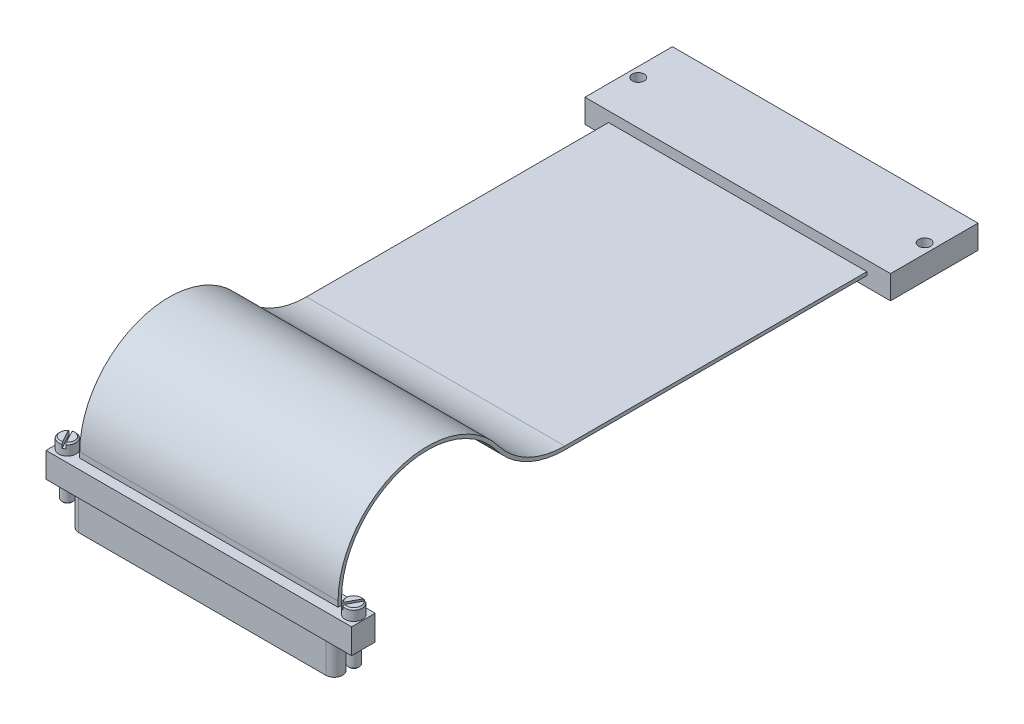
ISO-10303-21;
HEADER;
FILE_DESCRIPTION(('STEP AP214'),'2;1');
FILE_NAME('part.step','',(''),(''),'','','');
FILE_SCHEMA(('AUTOMOTIVE_DESIGN { 1 0 10303 214 1 1 1 1 }'));
ENDSEC;
DATA;
#1=APPLICATION_CONTEXT('core data for automotive mechanical design processes');
#2=APPLICATION_PROTOCOL_DEFINITION('international standard','automotive_design',2000,#1);
#3=PRODUCT_CONTEXT('',#1,'mechanical');
#4=PRODUCT('Part','Part','',(#3));
#5=PRODUCT_RELATED_PRODUCT_CATEGORY('part','',(#4));
#6=PRODUCT_DEFINITION_FORMATION('','',#4);
#7=PRODUCT_DEFINITION_CONTEXT('part definition',#1,'design');
#8=PRODUCT_DEFINITION('design','',#6,#7);
#9=PRODUCT_DEFINITION_SHAPE('','',#8);
#10=(LENGTH_UNIT() NAMED_UNIT(*) SI_UNIT(.MILLI.,.METRE.));
#11=(NAMED_UNIT(*) PLANE_ANGLE_UNIT() SI_UNIT($,.RADIAN.));
#12=(NAMED_UNIT(*) SI_UNIT($,.STERADIAN.) SOLID_ANGLE_UNIT());
#13=UNCERTAINTY_MEASURE_WITH_UNIT(LENGTH_MEASURE(1.E-05),#10,'distance_accuracy_value','');
#14=(GEOMETRIC_REPRESENTATION_CONTEXT(3) GLOBAL_UNCERTAINTY_ASSIGNED_CONTEXT((#13)) GLOBAL_UNIT_ASSIGNED_CONTEXT((#10,
#11,#12)) REPRESENTATION_CONTEXT('',''));
#15=CARTESIAN_POINT('',(0.,0.,0.));
#16=DIRECTION('',(0.,0.,1.));
#17=DIRECTION('',(1.,0.,0.));
#18=AXIS2_PLACEMENT_3D('',#15,#16,#17);
#19=CARTESIAN_POINT('',(13.0935,1.016,0.));
#20=DIRECTION('',(0.,1.,0.));
#21=DIRECTION('',(-1.,0.,0.));
#22=AXIS2_PLACEMENT_3D('',#19,#20,#21);
#23=PLANE('',#22);
#24=DIRECTION('',(0.472063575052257,0.,-0.881564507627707));
#25=VECTOR('',#24,1.);
#26=CARTESIAN_POINT('',(12.6163152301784,1.016,0.626333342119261));
#27=LINE('',#26,#25);
#28=CARTESIAN_POINT('',(12.6771890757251,1.016,0.512653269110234));
#29=VERTEX_POINT('',#28);
#30=CARTESIAN_POINT('',(13.2894197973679,1.016,-0.630669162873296));
#31=VERTEX_POINT('',#30);
#32=EDGE_CURVE('E302',#29,#31,#27,.T.);
#33=ORIENTED_EDGE('',*,*,#32,.T.);
#34=CARTESIAN_POINT('',(13.0935,1.016,0.));
#35=DIRECTION('',(0.,1.,0.));
#36=DIRECTION('',(-1.,0.,0.));
#37=AXIS2_PLACEMENT_3D('',#34,#35,#36);
#38=CIRCLE('',#37,0.660399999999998);
#39=EDGE_CURVE('E918',#31,#29,#38,.T.);
#40=ORIENTED_EDGE('',*,*,#39,.T.);
#41=EDGE_LOOP('',(#33,#40));
#42=FACE_BOUND('',#41,.T.);
#43=ADVANCED_FACE('F31',(#42),#23,.T.);
#44=CARTESIAN_POINT('',(-13.0935,1.016,0.));
#45=DIRECTION('',(0.,-1.,0.));
#46=DIRECTION('',(1.,0.,0.));
#47=AXIS2_PLACEMENT_3D('',#44,#45,#46);
#48=CYLINDRICAL_SURFACE('',#47,0.787400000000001);
#49=CARTESIAN_POINT('',(-13.0935,0.,0.));
#50=DIRECTION('',(0.,1.,0.));
#51=DIRECTION('',(-1.,0.,0.));
#52=AXIS2_PLACEMENT_3D('',#49,#50,#51);
#53=CIRCLE('',#52,0.787400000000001);
#54=CARTESIAN_POINT('',(-13.8809,0.,0.));
#55=VERTEX_POINT('',#54);
#56=EDGE_CURVE('E636',#55,#55,#53,.T.);
#57=ORIENTED_EDGE('',*,*,#56,.T.);
#58=EDGE_LOOP('',(#57));
#59=FACE_BOUND('',#58,.T.);
#60=DIRECTION('',(0.,1.,0.));
#61=VECTOR('',#60,1.);
#62=CARTESIAN_POINT('',(-12.8367063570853,0.571499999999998,0.744349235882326));
#63=LINE('',#62,#61);
#64=CARTESIAN_POINT('',(-12.8367063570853,0.571499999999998,0.744349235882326));
#65=VERTEX_POINT('',#64);
#66=CARTESIAN_POINT('',(-12.8367063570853,0.888999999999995,0.744349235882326));
#67=VERTEX_POINT('',#66);
#68=EDGE_CURVE('E333',#65,#67,#63,.T.);
#69=ORIENTED_EDGE('',*,*,#68,.T.);
#70=CARTESIAN_POINT('',(-13.0935,0.888999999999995,0.));
#71=DIRECTION('',(0.,-1.,0.));
#72=DIRECTION('',(0.,0.,-1.));
#73=AXIS2_PLACEMENT_3D('',#70,#71,#72);
#74=CIRCLE('',#73,0.787400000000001);
#75=CARTESIAN_POINT('',(-13.5706847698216,0.888999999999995,-0.626333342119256));
#76=VERTEX_POINT('',#75);
#77=EDGE_CURVE('E644',#67,#76,#74,.T.);
#78=ORIENTED_EDGE('',*,*,#77,.T.);
#79=DIRECTION('',(0.,1.,0.));
#80=VECTOR('',#79,1.);
#81=CARTESIAN_POINT('',(-13.5706847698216,0.571499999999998,-0.626333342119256));
#82=LINE('',#81,#80);
#83=CARTESIAN_POINT('',(-13.5706847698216,0.571499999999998,-0.626333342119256));
#84=VERTEX_POINT('',#83);
#85=EDGE_CURVE('E337',#84,#76,#82,.T.);
#86=ORIENTED_EDGE('',*,*,#85,.F.);
#87=CARTESIAN_POINT('',(-13.0935,0.571499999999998,0.));
#88=DIRECTION('',(0.,1.,0.));
#89=DIRECTION('',(-1.,0.,0.));
#90=AXIS2_PLACEMENT_3D('',#87,#88,#89);
#91=CIRCLE('',#90,0.787400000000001);
#92=CARTESIAN_POINT('',(-13.3502936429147,0.571499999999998,-0.744349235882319));
#93=VERTEX_POINT('',#92);
#94=EDGE_CURVE('E323',#93,#84,#91,.T.);
#95=ORIENTED_EDGE('',*,*,#94,.F.);
#96=DIRECTION('',(0.,1.,0.));
#97=VECTOR('',#96,1.);
#98=CARTESIAN_POINT('',(-13.3502936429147,0.571499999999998,-0.744349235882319));
#99=LINE('',#98,#97);
#100=CARTESIAN_POINT('',(-13.3502936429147,0.888999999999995,-0.744349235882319));
#101=VERTEX_POINT('',#100);
#102=EDGE_CURVE('E340',#93,#101,#99,.T.);
#103=ORIENTED_EDGE('',*,*,#102,.T.);
#104=CARTESIAN_POINT('',(-13.0935,0.888999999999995,0.));
#105=DIRECTION('',(0.,-1.,0.));
#106=DIRECTION('',(0.,0.,-1.));
#107=AXIS2_PLACEMENT_3D('',#104,#105,#106);
#108=CIRCLE('',#107,0.787400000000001);
#109=CARTESIAN_POINT('',(-12.6163152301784,0.888999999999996,0.626333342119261));
#110=VERTEX_POINT('',#109);
#111=EDGE_CURVE('E641',#101,#110,#108,.T.);
#112=ORIENTED_EDGE('',*,*,#111,.T.);
#113=DIRECTION('',(0.,1.,0.));
#114=VECTOR('',#113,1.);
#115=CARTESIAN_POINT('',(-12.6163152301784,0.571499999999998,0.626333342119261));
#116=LINE('',#115,#114);
#117=CARTESIAN_POINT('',(-12.6163152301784,0.571499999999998,0.626333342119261));
#118=VERTEX_POINT('',#117);
#119=EDGE_CURVE('E328',#118,#110,#116,.T.);
#120=ORIENTED_EDGE('',*,*,#119,.F.);
#121=CARTESIAN_POINT('',(-13.0935,0.571499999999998,0.));
#122=DIRECTION('',(0.,1.,0.));
#123=DIRECTION('',(-1.,0.,0.));
#124=AXIS2_PLACEMENT_3D('',#121,#122,#123);
#125=CIRCLE('',#124,0.7874);
#126=EDGE_CURVE('E316',#65,#118,#125,.T.);
#127=ORIENTED_EDGE('',*,*,#126,.F.);
#128=EDGE_LOOP('',(#69,#78,#86,#95,#103,#112,#120,#127));
#129=FACE_BOUND('',#128,.T.);
#130=ADVANCED_FACE('F707',(#59,#129),#48,.T.);
#131=CARTESIAN_POINT('',(-13.0935,1.016,0.));
#132=DIRECTION('',(0.,-1.,0.));
#133=DIRECTION('',(1.,0.,0.));
#134=AXIS2_PLACEMENT_3D('',#131,#132,#133);
#135=PLANE('',#134);
#136=DIRECTION('',(-0.472063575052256,0.,-0.881564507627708));
#137=VECTOR('',#136,1.);
#138=CARTESIAN_POINT('',(-12.8367063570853,1.016,0.744349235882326));
#139=LINE('',#138,#137);
#140=CARTESIAN_POINT('',(-12.8975802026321,1.016,0.630669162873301));
#141=VERTEX_POINT('',#140);
#142=CARTESIAN_POINT('',(-13.5098109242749,1.016,-0.512653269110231));
#143=VERTEX_POINT('',#142);
#144=EDGE_CURVE('E320',#141,#143,#139,.T.);
#145=ORIENTED_EDGE('',*,*,#144,.T.);
#146=CARTESIAN_POINT('',(-13.0935,1.016,0.));
#147=DIRECTION('',(0.,-1.,0.));
#148=DIRECTION('',(1.,0.,0.));
#149=AXIS2_PLACEMENT_3D('',#146,#147,#148);
#150=CIRCLE('',#149,0.660399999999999);
#151=EDGE_CURVE('E1577',#143,#141,#150,.F.);
#152=ORIENTED_EDGE('',*,*,#151,.T.);
#153=EDGE_LOOP('',(#145,#152));
#154=FACE_BOUND('',#153,.T.);
#155=ADVANCED_FACE('F706',(#154),#135,.F.);
#156=CARTESIAN_POINT('',(-13.97,0.,1.0795));
#157=DIRECTION('',(0.,1.,0.));
#158=DIRECTION('',(-1.,0.,0.));
#159=AXIS2_PLACEMENT_3D('',#156,#157,#158);
#160=PLANE('',#159);
#161=ORIENTED_EDGE('',*,*,#56,.F.);
#162=EDGE_LOOP('',(#161));
#163=FACE_BOUND('',#162,.T.);
#164=DIRECTION('',(-1.,0.,0.));
#165=VECTOR('',#164,1.);
#166=CARTESIAN_POINT('',(11.81,0.,-0.155));
#167=LINE('',#166,#165);
#168=CARTESIAN_POINT('',(11.81,0.,-0.155));
#169=VERTEX_POINT('',#168);
#170=CARTESIAN_POINT('',(-11.81,0.,-0.155));
#171=VERTEX_POINT('',#170);
#172=EDGE_CURVE('E463',#169,#171,#167,.T.);
#173=ORIENTED_EDGE('',*,*,#172,.F.);
#174=DIRECTION('',(0.,0.,-1.));
#175=VECTOR('',#174,1.);
#176=CARTESIAN_POINT('',(11.81,0.,0.155));
#177=LINE('',#176,#175);
#178=CARTESIAN_POINT('',(11.81,0.,0.155));
#179=VERTEX_POINT('',#178);
#180=EDGE_CURVE('E418',#179,#169,#177,.T.);
#181=ORIENTED_EDGE('',*,*,#180,.F.);
#182=DIRECTION('',(-1.,0.,0.));
#183=VECTOR('',#182,1.);
#184=CARTESIAN_POINT('',(11.81,0.,0.155));
#185=LINE('',#184,#183);
#186=CARTESIAN_POINT('',(-11.81,0.,0.155));
#187=VERTEX_POINT('',#186);
#188=EDGE_CURVE('E443',#179,#187,#185,.T.);
#189=ORIENTED_EDGE('',*,*,#188,.T.);
#190=DIRECTION('',(0.,0.,-1.));
#191=VECTOR('',#190,1.);
#192=CARTESIAN_POINT('',(-11.81,0.,0.155));
#193=LINE('',#192,#191);
#194=EDGE_CURVE('E389',#187,#171,#193,.T.);
#195=ORIENTED_EDGE('',*,*,#194,.T.);
#196=EDGE_LOOP('',(#173,#181,#189,#195));
#197=FACE_BOUND('',#196,.T.);
#198=DIRECTION('',(0.,0.,-1.));
#199=VECTOR('',#198,1.);
#200=CARTESIAN_POINT('',(13.97,0.,1.0795));
#201=LINE('',#200,#199);
#202=CARTESIAN_POINT('',(13.97,0.,1.0795));
#203=VERTEX_POINT('',#202);
#204=CARTESIAN_POINT('',(13.97,0.,-1.0795));
#205=VERTEX_POINT('',#204);
#206=EDGE_CURVE('E630',#203,#205,#201,.T.);
#207=ORIENTED_EDGE('',*,*,#206,.T.);
#208=DIRECTION('',(1.,0.,0.));
#209=VECTOR('',#208,1.);
#210=CARTESIAN_POINT('',(-13.97,0.,-1.0795));
#211=LINE('',#210,#209);
#212=CARTESIAN_POINT('',(-13.97,0.,-1.0795));
#213=VERTEX_POINT('',#212);
#214=EDGE_CURVE('E615',#213,#205,#211,.T.);
#215=ORIENTED_EDGE('',*,*,#214,.F.);
#216=DIRECTION('',(0.,0.,-1.));
#217=VECTOR('',#216,1.);
#218=CARTESIAN_POINT('',(-13.97,0.,1.0795));
#219=LINE('',#218,#217);
#220=CARTESIAN_POINT('',(-13.97,0.,1.0795));
#221=VERTEX_POINT('',#220);
#222=EDGE_CURVE('E628',#221,#213,#219,.T.);
#223=ORIENTED_EDGE('',*,*,#222,.F.);
#224=DIRECTION('',(1.,0.,0.));
#225=VECTOR('',#224,1.);
#226=CARTESIAN_POINT('',(-13.97,0.,1.0795));
#227=LINE('',#226,#225);
#228=EDGE_CURVE('E625',#221,#203,#227,.T.);
#229=ORIENTED_EDGE('',*,*,#228,.T.);
#230=EDGE_LOOP('',(#207,#215,#223,#229));
#231=FACE_BOUND('',#230,.T.);
#232=CARTESIAN_POINT('',(13.0935,0.,0.));
#233=DIRECTION('',(0.,1.,0.));
#234=DIRECTION('',(-1.,0.,0.));
#235=AXIS2_PLACEMENT_3D('',#232,#233,#234);
#236=CIRCLE('',#235,0.787400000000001);
#237=CARTESIAN_POINT('',(12.3061,0.,0.));
#238=VERTEX_POINT('',#237);
#239=EDGE_CURVE('E336',#238,#238,#236,.T.);
#240=ORIENTED_EDGE('',*,*,#239,.F.);
#241=EDGE_LOOP('',(#240));
#242=FACE_BOUND('',#241,.T.);
#243=ADVANCED_FACE('F749',(#163,#197,#231,#242),#160,.T.);
#244=CARTESIAN_POINT('',(13.97,1.17100000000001,-48.1957147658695));
#245=DIRECTION('',(0.,1.,0.));
#246=DIRECTION('',(0.,0.,1.));
#247=AXIS2_PLACEMENT_3D('',#244,#245,#246);
#248=PLANE('',#247);
#249=DIRECTION('',(-1.,0.,0.));
#250=VECTOR('',#249,1.);
#251=CARTESIAN_POINT('',(13.97,1.17100000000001,-48.1957147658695));
#252=LINE('',#251,#250);
#253=CARTESIAN_POINT('',(13.97,1.17100000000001,-48.1957147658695));
#254=VERTEX_POINT('',#253);
#255=CARTESIAN_POINT('',(-13.97,1.17100000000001,-48.1957147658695));
#256=VERTEX_POINT('',#255);
#257=EDGE_CURVE('E381',#254,#256,#252,.T.);
#258=ORIENTED_EDGE('',*,*,#257,.T.);
#259=DIRECTION('',(0.,0.,-1.));
#260=VECTOR('',#259,1.);
#261=CARTESIAN_POINT('',(-13.97,1.17100000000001,-48.1957147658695));
#262=LINE('',#261,#260);
#263=CARTESIAN_POINT('',(-13.97,1.17100000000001,-56.1957147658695));
#264=VERTEX_POINT('',#263);
#265=EDGE_CURVE('E359',#256,#264,#262,.T.);
#266=ORIENTED_EDGE('',*,*,#265,.T.);
#267=DIRECTION('',(-1.,0.,0.));
#268=VECTOR('',#267,1.);
#269=CARTESIAN_POINT('',(13.97,1.17100000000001,-56.1957147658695));
#270=LINE('',#269,#268);
#271=CARTESIAN_POINT('',(13.97,1.17100000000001,-56.1957147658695));
#272=VERTEX_POINT('',#271);
#273=EDGE_CURVE('E387',#272,#264,#270,.T.);
#274=ORIENTED_EDGE('',*,*,#273,.F.);
#275=DIRECTION('',(0.,0.,-1.));
#276=VECTOR('',#275,1.);
#277=CARTESIAN_POINT('',(13.97,1.17100000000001,-48.1957147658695));
#278=LINE('',#277,#276);
#279=EDGE_CURVE('E371',#254,#272,#278,.T.);
#280=ORIENTED_EDGE('',*,*,#279,.F.);
#281=EDGE_LOOP('',(#258,#266,#274,#280));
#282=FACE_BOUND('',#281,.T.);
#283=CARTESIAN_POINT('',(13.0935,1.17100000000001,-52.1957147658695));
#284=DIRECTION('',(0.,1.,0.));
#285=DIRECTION('',(0.,0.,1.));
#286=AXIS2_PLACEMENT_3D('',#283,#284,#285);
#287=CIRCLE('',#286,0.55);
#288=CARTESIAN_POINT('',(13.0935,1.17100000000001,-51.6457147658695));
#289=VERTEX_POINT('',#288);
#290=EDGE_CURVE('E356',#289,#289,#287,.T.);
#291=ORIENTED_EDGE('',*,*,#290,.T.);
#292=EDGE_LOOP('',(#291));
#293=FACE_BOUND('',#292,.T.);
#294=CARTESIAN_POINT('',(-13.0935,1.17100000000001,-52.1957147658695));
#295=DIRECTION('',(0.,1.,0.));
#296=DIRECTION('',(0.,0.,1.));
#297=AXIS2_PLACEMENT_3D('',#294,#295,#296);
#298=CIRCLE('',#297,0.55);
#299=CARTESIAN_POINT('',(-13.0935,1.17100000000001,-51.6457147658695));
#300=VERTEX_POINT('',#299);
#301=EDGE_CURVE('E350',#300,#300,#298,.F.);
#302=ORIENTED_EDGE('',*,*,#301,.F.);
#303=EDGE_LOOP('',(#302));
#304=FACE_BOUND('',#303,.T.);
#305=ADVANCED_FACE('F742',(#282,#293,#304),#248,.F.);
#306=CARTESIAN_POINT('',(13.97,3.33,-48.1957147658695));
#307=DIRECTION('',(0.,1.,0.));
#308=DIRECTION('',(0.,0.,1.));
#309=AXIS2_PLACEMENT_3D('',#306,#307,#308);
#310=PLANE('',#309);
#311=DIRECTION('',(-1.,0.,0.));
#312=VECTOR('',#311,1.);
#313=CARTESIAN_POINT('',(13.97,3.33,-56.1957147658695));
#314=LINE('',#313,#312);
#315=CARTESIAN_POINT('',(13.97,3.33,-56.1957147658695));
#316=VERTEX_POINT('',#315);
#317=CARTESIAN_POINT('',(-13.97,3.33,-56.1957147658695));
#318=VERTEX_POINT('',#317);
#319=EDGE_CURVE('E385',#316,#318,#314,.T.);
#320=ORIENTED_EDGE('',*,*,#319,.T.);
#321=DIRECTION('',(0.,0.,-1.));
#322=VECTOR('',#321,1.);
#323=CARTESIAN_POINT('',(-13.97,3.33,-48.1957147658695));
#324=LINE('',#323,#322);
#325=CARTESIAN_POINT('',(-13.97,3.33,-48.1957147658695));
#326=VERTEX_POINT('',#325);
#327=EDGE_CURVE('E365',#326,#318,#324,.T.);
#328=ORIENTED_EDGE('',*,*,#327,.F.);
#329=DIRECTION('',(-1.,0.,0.));
#330=VECTOR('',#329,1.);
#331=CARTESIAN_POINT('',(13.97,3.33,-48.1957147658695));
#332=LINE('',#331,#330);
#333=CARTESIAN_POINT('',(13.97,3.33,-48.1957147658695));
#334=VERTEX_POINT('',#333);
#335=EDGE_CURVE('E383',#334,#326,#332,.T.);
#336=ORIENTED_EDGE('',*,*,#335,.F.);
#337=DIRECTION('',(0.,0.,-1.));
#338=VECTOR('',#337,1.);
#339=CARTESIAN_POINT('',(13.97,3.33,-48.1957147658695));
#340=LINE('',#339,#338);
#341=EDGE_CURVE('E376',#334,#316,#340,.T.);
#342=ORIENTED_EDGE('',*,*,#341,.T.);
#343=EDGE_LOOP('',(#320,#328,#336,#342));
#344=FACE_BOUND('',#343,.T.);
#345=CARTESIAN_POINT('',(13.0935,3.33,-52.1957147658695));
#346=DIRECTION('',(0.,1.,0.));
#347=DIRECTION('',(0.,0.,1.));
#348=AXIS2_PLACEMENT_3D('',#345,#346,#347);
#349=CIRCLE('',#348,0.55);
#350=CARTESIAN_POINT('',(13.0935,3.33,-51.6457147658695));
#351=VERTEX_POINT('',#350);
#352=EDGE_CURVE('E353',#351,#351,#349,.T.);
#353=ORIENTED_EDGE('',*,*,#352,.F.);
#354=EDGE_LOOP('',(#353));
#355=FACE_BOUND('',#354,.T.);
#356=CARTESIAN_POINT('',(-13.0935,3.33,-52.1957147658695));
#357=DIRECTION('',(0.,-1.,0.));
#358=DIRECTION('',(0.,0.,-1.));
#359=AXIS2_PLACEMENT_3D('',#356,#357,#358);
#360=CIRCLE('',#359,0.55);
#361=CARTESIAN_POINT('',(-13.0935,3.33,-52.7457147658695));
#362=VERTEX_POINT('',#361);
#363=EDGE_CURVE('E347',#362,#362,#360,.T.);
#364=ORIENTED_EDGE('',*,*,#363,.T.);
#365=EDGE_LOOP('',(#364));
#366=FACE_BOUND('',#365,.T.);
#367=ADVANCED_FACE('F738',(#344,#355,#366),#310,.T.);
#368=CARTESIAN_POINT('',(0.,-2.286,0.));
#369=DIRECTION('',(0.,-1.,0.));
#370=DIRECTION('',(1.,0.,0.));
#371=AXIS2_PLACEMENT_3D('',#368,#369,#370);
#372=CYLINDRICAL_SURFACE('',#371,0.127);
#373=CARTESIAN_POINT('',(0.,-2.286,0.));
#374=DIRECTION('',(0.,-1.,0.));
#375=DIRECTION('',(1.,0.,0.));
#376=AXIS2_PLACEMENT_3D('',#373,#374,#375);
#377=CIRCLE('',#376,0.127);
#378=CARTESIAN_POINT('',(0.127,-2.286,0.));
#379=VERTEX_POINT('',#378);
#380=EDGE_CURVE('E539',#379,#379,#377,.T.);
#381=ORIENTED_EDGE('',*,*,#380,.T.);
#382=EDGE_LOOP('',(#381));
#383=FACE_BOUND('',#382,.T.);
#384=CARTESIAN_POINT('',(0.,-4.834,0.));
#385=DIRECTION('',(0.,-1.,0.));
#386=DIRECTION('',(1.,0.,0.));
#387=AXIS2_PLACEMENT_3D('',#384,#385,#386);
#388=CIRCLE('',#387,0.127);
#389=CARTESIAN_POINT('',(0.127000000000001,-4.834,0.));
#390=VERTEX_POINT('',#389);
#391=EDGE_CURVE('E500',#390,#390,#388,.F.);
#392=ORIENTED_EDGE('',*,*,#391,.T.);
#393=EDGE_LOOP('',(#392));
#394=FACE_BOUND('',#393,.T.);
#395=ADVANCED_FACE('F741',(#383,#394),#372,.T.);
#396=CARTESIAN_POINT('',(1.87325,-2.286,0.));
#397=DIRECTION('',(0.,-1.,0.));
#398=DIRECTION('',(1.,0.,0.));
#399=AXIS2_PLACEMENT_3D('',#396,#397,#398);
#400=CYLINDRICAL_SURFACE('',#399,0.127);
#401=CARTESIAN_POINT('',(1.87325,-2.286,0.));
#402=DIRECTION('',(0.,-1.,0.));
#403=DIRECTION('',(1.,0.,0.));
#404=AXIS2_PLACEMENT_3D('',#401,#402,#403);
#405=CIRCLE('',#404,0.127);
#406=CARTESIAN_POINT('',(2.00025,-2.286,0.));
#407=VERTEX_POINT('',#406);
#408=EDGE_CURVE('E536',#407,#407,#405,.T.);
#409=ORIENTED_EDGE('',*,*,#408,.T.);
#410=EDGE_LOOP('',(#409));
#411=FACE_BOUND('',#410,.T.);
#412=CARTESIAN_POINT('',(1.87325,-4.834,0.));
#413=DIRECTION('',(0.,-1.,0.));
#414=DIRECTION('',(1.,0.,0.));
#415=AXIS2_PLACEMENT_3D('',#412,#413,#414);
#416=CIRCLE('',#415,0.127);
#417=CARTESIAN_POINT('',(2.00025,-4.834,0.));
#418=VERTEX_POINT('',#417);
#419=EDGE_CURVE('E497',#418,#418,#416,.F.);
#420=ORIENTED_EDGE('',*,*,#419,.T.);
#421=EDGE_LOOP('',(#420));
#422=FACE_BOUND('',#421,.T.);
#423=ADVANCED_FACE('F841',(#411,#422),#400,.T.);
#424=CARTESIAN_POINT('',(3.7465,-2.286,0.));
#425=DIRECTION('',(0.,-1.,0.));
#426=DIRECTION('',(1.,0.,0.));
#427=AXIS2_PLACEMENT_3D('',#424,#425,#426);
#428=CYLINDRICAL_SURFACE('',#427,0.127);
#429=CARTESIAN_POINT('',(3.7465,-2.286,0.));
#430=DIRECTION('',(0.,-1.,0.));
#431=DIRECTION('',(1.,0.,0.));
#432=AXIS2_PLACEMENT_3D('',#429,#430,#431);
#433=CIRCLE('',#432,0.127);
#434=CARTESIAN_POINT('',(3.8735,-2.286,0.));
#435=VERTEX_POINT('',#434);
#436=EDGE_CURVE('E533',#435,#435,#433,.T.);
#437=ORIENTED_EDGE('',*,*,#436,.T.);
#438=EDGE_LOOP('',(#437));
#439=FACE_BOUND('',#438,.T.);
#440=CARTESIAN_POINT('',(3.7465,-4.834,0.));
#441=DIRECTION('',(0.,-1.,0.));
#442=DIRECTION('',(1.,0.,0.));
#443=AXIS2_PLACEMENT_3D('',#440,#441,#442);
#444=CIRCLE('',#443,0.127);
#445=CARTESIAN_POINT('',(3.8735,-4.834,0.));
#446=VERTEX_POINT('',#445);
#447=EDGE_CURVE('E494',#446,#446,#444,.F.);
#448=ORIENTED_EDGE('',*,*,#447,.T.);
#449=EDGE_LOOP('',(#448));
#450=FACE_BOUND('',#449,.T.);
#451=ADVANCED_FACE('F837',(#439,#450),#428,.T.);
#452=CARTESIAN_POINT('',(5.61975,-2.286,0.));
#453=DIRECTION('',(0.,-1.,0.));
#454=DIRECTION('',(1.,0.,0.));
#455=AXIS2_PLACEMENT_3D('',#452,#453,#454);
#456=CYLINDRICAL_SURFACE('',#455,0.127);
#457=CARTESIAN_POINT('',(5.61975,-2.286,0.));
#458=DIRECTION('',(0.,-1.,0.));
#459=DIRECTION('',(1.,0.,0.));
#460=AXIS2_PLACEMENT_3D('',#457,#458,#459);
#461=CIRCLE('',#460,0.127);
#462=CARTESIAN_POINT('',(5.74675,-2.286,0.));
#463=VERTEX_POINT('',#462);
#464=EDGE_CURVE('E530',#463,#463,#461,.T.);
#465=ORIENTED_EDGE('',*,*,#464,.T.);
#466=EDGE_LOOP('',(#465));
#467=FACE_BOUND('',#466,.T.);
#468=CARTESIAN_POINT('',(5.61975,-4.834,0.));
#469=DIRECTION('',(0.,-1.,0.));
#470=DIRECTION('',(1.,0.,0.));
#471=AXIS2_PLACEMENT_3D('',#468,#469,#470);
#472=CIRCLE('',#471,0.127);
#473=CARTESIAN_POINT('',(5.74675,-4.834,0.));
#474=VERTEX_POINT('',#473);
#475=EDGE_CURVE('E491',#474,#474,#472,.F.);
#476=ORIENTED_EDGE('',*,*,#475,.T.);
#477=EDGE_LOOP('',(#476));
#478=FACE_BOUND('',#477,.T.);
#479=ADVANCED_FACE('F833',(#467,#478),#456,.T.);
#480=CARTESIAN_POINT('',(7.493,-2.286,0.));
#481=DIRECTION('',(0.,-1.,0.));
#482=DIRECTION('',(1.,0.,0.));
#483=AXIS2_PLACEMENT_3D('',#480,#481,#482);
#484=CYLINDRICAL_SURFACE('',#483,0.127);
#485=CARTESIAN_POINT('',(7.493,-2.286,0.));
#486=DIRECTION('',(0.,-1.,0.));
#487=DIRECTION('',(1.,0.,0.));
#488=AXIS2_PLACEMENT_3D('',#485,#486,#487);
#489=CIRCLE('',#488,0.127);
#490=CARTESIAN_POINT('',(7.62,-2.286,0.));
#491=VERTEX_POINT('',#490);
#492=EDGE_CURVE('E527',#491,#491,#489,.T.);
#493=ORIENTED_EDGE('',*,*,#492,.T.);
#494=EDGE_LOOP('',(#493));
#495=FACE_BOUND('',#494,.T.);
#496=CARTESIAN_POINT('',(7.493,-4.834,0.));
#497=DIRECTION('',(0.,-1.,0.));
#498=DIRECTION('',(1.,0.,0.));
#499=AXIS2_PLACEMENT_3D('',#496,#497,#498);
#500=CIRCLE('',#499,0.127);
#501=CARTESIAN_POINT('',(7.62,-4.834,0.));
#502=VERTEX_POINT('',#501);
#503=EDGE_CURVE('E488',#502,#502,#500,.F.);
#504=ORIENTED_EDGE('',*,*,#503,.T.);
#505=EDGE_LOOP('',(#504));
#506=FACE_BOUND('',#505,.T.);
#507=ADVANCED_FACE('F829',(#495,#506),#484,.T.);
#508=CARTESIAN_POINT('',(-5.61975,-2.286,0.));
#509=DIRECTION('',(0.,-1.,0.));
#510=DIRECTION('',(1.,0.,0.));
#511=AXIS2_PLACEMENT_3D('',#508,#509,#510);
#512=CYLINDRICAL_SURFACE('',#511,0.127);
#513=CARTESIAN_POINT('',(-5.61975,-2.286,0.));
#514=DIRECTION('',(0.,1.,0.));
#515=DIRECTION('',(-1.,0.,0.));
#516=AXIS2_PLACEMENT_3D('',#513,#514,#515);
#517=CIRCLE('',#516,0.127);
#518=CARTESIAN_POINT('',(-5.74675,-2.286,0.));
#519=VERTEX_POINT('',#518);
#520=EDGE_CURVE('E524',#519,#519,#517,.T.);
#521=ORIENTED_EDGE('',*,*,#520,.F.);
#522=EDGE_LOOP('',(#521));
#523=FACE_BOUND('',#522,.T.);
#524=CARTESIAN_POINT('',(-5.61975,-4.834,0.));
#525=DIRECTION('',(0.,-1.,0.));
#526=DIRECTION('',(1.,0.,0.));
#527=AXIS2_PLACEMENT_3D('',#524,#525,#526);
#528=CIRCLE('',#527,0.127);
#529=CARTESIAN_POINT('',(-5.49275,-4.834,0.));
#530=VERTEX_POINT('',#529);
#531=EDGE_CURVE('E485',#530,#530,#528,.T.);
#532=ORIENTED_EDGE('',*,*,#531,.F.);
#533=EDGE_LOOP('',(#532));
#534=FACE_BOUND('',#533,.T.);
#535=ADVANCED_FACE('F825',(#523,#534),#512,.T.);
#536=CARTESIAN_POINT('',(-3.7465,-2.286,0.));
#537=DIRECTION('',(0.,-1.,0.));
#538=DIRECTION('',(1.,0.,0.));
#539=AXIS2_PLACEMENT_3D('',#536,#537,#538);
#540=CYLINDRICAL_SURFACE('',#539,0.127);
#541=CARTESIAN_POINT('',(-3.7465,-2.286,0.));
#542=DIRECTION('',(0.,1.,0.));
#543=DIRECTION('',(-1.,0.,0.));
#544=AXIS2_PLACEMENT_3D('',#541,#542,#543);
#545=CIRCLE('',#544,0.127);
#546=CARTESIAN_POINT('',(-3.8735,-2.286,0.));
#547=VERTEX_POINT('',#546);
#548=EDGE_CURVE('E521',#547,#547,#545,.T.);
#549=ORIENTED_EDGE('',*,*,#548,.F.);
#550=EDGE_LOOP('',(#549));
#551=FACE_BOUND('',#550,.T.);
#552=CARTESIAN_POINT('',(-3.7465,-4.834,0.));
#553=DIRECTION('',(0.,-1.,0.));
#554=DIRECTION('',(1.,0.,0.));
#555=AXIS2_PLACEMENT_3D('',#552,#553,#554);
#556=CIRCLE('',#555,0.127);
#557=CARTESIAN_POINT('',(-3.6195,-4.834,0.));
#558=VERTEX_POINT('',#557);
#559=EDGE_CURVE('E482',#558,#558,#556,.T.);
#560=ORIENTED_EDGE('',*,*,#559,.F.);
#561=EDGE_LOOP('',(#560));
#562=FACE_BOUND('',#561,.T.);
#563=ADVANCED_FACE('F821',(#551,#562),#540,.T.);
#564=CARTESIAN_POINT('',(-1.87325,-2.286,0.));
#565=DIRECTION('',(0.,-1.,0.));
#566=DIRECTION('',(1.,0.,0.));
#567=AXIS2_PLACEMENT_3D('',#564,#565,#566);
#568=CYLINDRICAL_SURFACE('',#567,0.127);
#569=CARTESIAN_POINT('',(-1.87325,-2.286,0.));
#570=DIRECTION('',(0.,1.,0.));
#571=DIRECTION('',(-1.,0.,0.));
#572=AXIS2_PLACEMENT_3D('',#569,#570,#571);
#573=CIRCLE('',#572,0.127);
#574=CARTESIAN_POINT('',(-2.00025,-2.286,0.));
#575=VERTEX_POINT('',#574);
#576=EDGE_CURVE('E518',#575,#575,#573,.T.);
#577=ORIENTED_EDGE('',*,*,#576,.F.);
#578=EDGE_LOOP('',(#577));
#579=FACE_BOUND('',#578,.T.);
#580=CARTESIAN_POINT('',(-1.87325,-4.834,0.));
#581=DIRECTION('',(0.,-1.,0.));
#582=DIRECTION('',(1.,0.,0.));
#583=AXIS2_PLACEMENT_3D('',#580,#581,#582);
#584=CIRCLE('',#583,0.127);
#585=CARTESIAN_POINT('',(-1.74625,-4.834,0.));
#586=VERTEX_POINT('',#585);
#587=EDGE_CURVE('E479',#586,#586,#584,.T.);
#588=ORIENTED_EDGE('',*,*,#587,.F.);
#589=EDGE_LOOP('',(#588));
#590=FACE_BOUND('',#589,.T.);
#591=ADVANCED_FACE('F817',(#579,#590),#568,.T.);
#592=CARTESIAN_POINT('',(9.36625,-2.286,0.));
#593=DIRECTION('',(0.,-1.,0.));
#594=DIRECTION('',(1.,0.,0.));
#595=AXIS2_PLACEMENT_3D('',#592,#593,#594);
#596=CYLINDRICAL_SURFACE('',#595,0.127);
#597=CARTESIAN_POINT('',(9.36625,-2.286,0.));
#598=DIRECTION('',(0.,1.,0.));
#599=DIRECTION('',(-1.,0.,0.));
#600=AXIS2_PLACEMENT_3D('',#597,#598,#599);
#601=CIRCLE('',#600,0.127);
#602=CARTESIAN_POINT('',(9.23925,-2.286,0.));
#603=VERTEX_POINT('',#602);
#604=EDGE_CURVE('E515',#603,#603,#601,.T.);
#605=ORIENTED_EDGE('',*,*,#604,.F.);
#606=EDGE_LOOP('',(#605));
#607=FACE_BOUND('',#606,.T.);
#608=CARTESIAN_POINT('',(9.36625,-4.834,0.));
#609=DIRECTION('',(0.,-1.,0.));
#610=DIRECTION('',(1.,0.,0.));
#611=AXIS2_PLACEMENT_3D('',#608,#609,#610);
#612=CIRCLE('',#611,0.127);
#613=CARTESIAN_POINT('',(9.49325,-4.834,0.));
#614=VERTEX_POINT('',#613);
#615=EDGE_CURVE('E476',#614,#614,#612,.T.);
#616=ORIENTED_EDGE('',*,*,#615,.F.);
#617=EDGE_LOOP('',(#616));
#618=FACE_BOUND('',#617,.T.);
#619=ADVANCED_FACE('F813',(#607,#618),#596,.T.);
#620=CARTESIAN_POINT('',(11.2395,-2.286,0.));
#621=DIRECTION('',(0.,-1.,0.));
#622=DIRECTION('',(1.,0.,0.));
#623=AXIS2_PLACEMENT_3D('',#620,#621,#622);
#624=CYLINDRICAL_SURFACE('',#623,0.127);
#625=CARTESIAN_POINT('',(11.2395,-2.286,0.));
#626=DIRECTION('',(0.,1.,0.));
#627=DIRECTION('',(-1.,0.,0.));
#628=AXIS2_PLACEMENT_3D('',#625,#626,#627);
#629=CIRCLE('',#628,0.127);
#630=CARTESIAN_POINT('',(11.1125,-2.286,0.));
#631=VERTEX_POINT('',#630);
#632=EDGE_CURVE('E512',#631,#631,#629,.T.);
#633=ORIENTED_EDGE('',*,*,#632,.F.);
#634=EDGE_LOOP('',(#633));
#635=FACE_BOUND('',#634,.T.);
#636=CARTESIAN_POINT('',(11.2395,-4.834,0.));
#637=DIRECTION('',(0.,-1.,0.));
#638=DIRECTION('',(1.,0.,0.));
#639=AXIS2_PLACEMENT_3D('',#636,#637,#638);
#640=CIRCLE('',#639,0.127);
#641=CARTESIAN_POINT('',(11.3665,-4.834,0.));
#642=VERTEX_POINT('',#641);
#643=EDGE_CURVE('E473',#642,#642,#640,.T.);
#644=ORIENTED_EDGE('',*,*,#643,.F.);
#645=EDGE_LOOP('',(#644));
#646=FACE_BOUND('',#645,.T.);
#647=ADVANCED_FACE('F809',(#635,#646),#624,.T.);
#648=CARTESIAN_POINT('',(-11.2395,-2.286,0.));
#649=DIRECTION('',(0.,-1.,0.));
#650=DIRECTION('',(1.,0.,0.));
#651=AXIS2_PLACEMENT_3D('',#648,#649,#650);
#652=CYLINDRICAL_SURFACE('',#651,0.127);
#653=CARTESIAN_POINT('',(-11.2395,-2.286,0.));
#654=DIRECTION('',(0.,-1.,0.));
#655=DIRECTION('',(1.,0.,0.));
#656=AXIS2_PLACEMENT_3D('',#653,#654,#655);
#657=CIRCLE('',#656,0.127);
#658=CARTESIAN_POINT('',(-11.1125,-2.286,0.));
#659=VERTEX_POINT('',#658);
#660=EDGE_CURVE('E509',#659,#659,#657,.T.);
#661=ORIENTED_EDGE('',*,*,#660,.T.);
#662=EDGE_LOOP('',(#661));
#663=FACE_BOUND('',#662,.T.);
#664=CARTESIAN_POINT('',(-11.2395,-4.834,0.));
#665=DIRECTION('',(0.,-1.,0.));
#666=DIRECTION('',(1.,0.,0.));
#667=AXIS2_PLACEMENT_3D('',#664,#665,#666);
#668=CIRCLE('',#667,0.127);
#669=CARTESIAN_POINT('',(-11.1125,-4.834,0.));
#670=VERTEX_POINT('',#669);
#671=EDGE_CURVE('E470',#670,#670,#668,.F.);
#672=ORIENTED_EDGE('',*,*,#671,.T.);
#673=EDGE_LOOP('',(#672));
#674=FACE_BOUND('',#673,.T.);
#675=ADVANCED_FACE('F805',(#663,#674),#652,.T.);
#676=CARTESIAN_POINT('',(-9.36625,-2.286,0.));
#677=DIRECTION('',(0.,-1.,0.));
#678=DIRECTION('',(1.,0.,0.));
#679=AXIS2_PLACEMENT_3D('',#676,#677,#678);
#680=CYLINDRICAL_SURFACE('',#679,0.127);
#681=CARTESIAN_POINT('',(-9.36625,-2.286,0.));
#682=DIRECTION('',(0.,-1.,0.));
#683=DIRECTION('',(1.,0.,0.));
#684=AXIS2_PLACEMENT_3D('',#681,#682,#683);
#685=CIRCLE('',#684,0.127);
#686=CARTESIAN_POINT('',(-9.23925,-2.286,0.));
#687=VERTEX_POINT('',#686);
#688=EDGE_CURVE('E506',#687,#687,#685,.T.);
#689=ORIENTED_EDGE('',*,*,#688,.T.);
#690=EDGE_LOOP('',(#689));
#691=FACE_BOUND('',#690,.T.);
#692=CARTESIAN_POINT('',(-9.36625,-4.834,0.));
#693=DIRECTION('',(0.,-1.,0.));
#694=DIRECTION('',(1.,0.,0.));
#695=AXIS2_PLACEMENT_3D('',#692,#693,#694);
#696=CIRCLE('',#695,0.127);
#697=CARTESIAN_POINT('',(-9.23925,-4.834,0.));
#698=VERTEX_POINT('',#697);
#699=EDGE_CURVE('E467',#698,#698,#696,.F.);
#700=ORIENTED_EDGE('',*,*,#699,.T.);
#701=EDGE_LOOP('',(#700));
#702=FACE_BOUND('',#701,.T.);
#703=ADVANCED_FACE('F801',(#691,#702),#680,.T.);
#704=CARTESIAN_POINT('',(-7.493,-2.286,0.));
#705=DIRECTION('',(0.,-1.,0.));
#706=DIRECTION('',(1.,0.,0.));
#707=AXIS2_PLACEMENT_3D('',#704,#705,#706);
#708=CYLINDRICAL_SURFACE('',#707,0.127);
#709=CARTESIAN_POINT('',(-7.493,-2.286,0.));
#710=DIRECTION('',(0.,1.,0.));
#711=DIRECTION('',(-1.,0.,0.));
#712=AXIS2_PLACEMENT_3D('',#709,#710,#711);
#713=CIRCLE('',#712,0.127);
#714=CARTESIAN_POINT('',(-7.62,-2.286,0.));
#715=VERTEX_POINT('',#714);
#716=EDGE_CURVE('E503',#715,#715,#713,.T.);
#717=ORIENTED_EDGE('',*,*,#716,.F.);
#718=EDGE_LOOP('',(#717));
#719=FACE_BOUND('',#718,.T.);
#720=CARTESIAN_POINT('',(-7.493,-4.834,0.));
#721=DIRECTION('',(0.,-1.,0.));
#722=DIRECTION('',(1.,0.,0.));
#723=AXIS2_PLACEMENT_3D('',#720,#721,#722);
#724=CIRCLE('',#723,0.127);
#725=CARTESIAN_POINT('',(-7.366,-4.834,0.));
#726=VERTEX_POINT('',#725);
#727=EDGE_CURVE('E466',#726,#726,#724,.T.);
#728=ORIENTED_EDGE('',*,*,#727,.F.);
#729=EDGE_LOOP('',(#728));
#730=FACE_BOUND('',#729,.T.);
#731=ADVANCED_FACE('F797',(#719,#730),#708,.T.);
#732=CARTESIAN_POINT('',(11.303,-5.334,0.));
#733=DIRECTION('',(0.,-1.,0.));
#734=DIRECTION('',(1.,0.,0.));
#735=AXIS2_PLACEMENT_3D('',#732,#733,#734);
#736=PLANE('',#735);
#737=CARTESIAN_POINT('',(11.303,-5.334,0.));
#738=DIRECTION('',(0.,-1.,0.));
#739=DIRECTION('',(1.,0.,0.));
#740=AXIS2_PLACEMENT_3D('',#737,#738,#739);
#741=CIRCLE('',#740,0.635000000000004);
#742=CARTESIAN_POINT('',(11.303,-5.334,-0.635000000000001));
#743=VERTEX_POINT('',#742);
#744=CARTESIAN_POINT('',(11.303,-5.334,0.635000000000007));
#745=VERTEX_POINT('',#744);
#746=EDGE_CURVE('E542',#743,#745,#741,.T.);
#747=ORIENTED_EDGE('',*,*,#746,.F.);
#748=DIRECTION('',(-1.,0.,0.));
#749=VECTOR('',#748,1.);
#750=CARTESIAN_POINT('',(11.303,-5.334,-0.635000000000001));
#751=LINE('',#750,#749);
#752=CARTESIAN_POINT('',(-11.303,-5.334,-0.635000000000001));
#753=VERTEX_POINT('',#752);
#754=EDGE_CURVE('E547',#743,#753,#751,.T.);
#755=ORIENTED_EDGE('',*,*,#754,.T.);
#756=CARTESIAN_POINT('',(-11.303,-5.334,0.));
#757=DIRECTION('',(0.,-1.,0.));
#758=DIRECTION('',(1.,0.,0.));
#759=AXIS2_PLACEMENT_3D('',#756,#757,#758);
#760=CIRCLE('',#759,0.635000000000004);
#761=CARTESIAN_POINT('',(-11.303,-5.334,0.635000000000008));
#762=VERTEX_POINT('',#761);
#763=EDGE_CURVE('E561',#762,#753,#760,.T.);
#764=ORIENTED_EDGE('',*,*,#763,.F.);
#765=DIRECTION('',(-1.,0.,0.));
#766=VECTOR('',#765,1.);
#767=CARTESIAN_POINT('',(11.303,-5.334,0.635000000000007));
#768=LINE('',#767,#766);
#769=EDGE_CURVE('E558',#745,#762,#768,.T.);
#770=ORIENTED_EDGE('',*,*,#769,.F.);
#771=EDGE_LOOP('',(#747,#755,#764,#770));
#772=FACE_BOUND('',#771,.T.);
#773=CARTESIAN_POINT('',(11.303,-5.334,0.));
#774=DIRECTION('',(0.,-1.,0.));
#775=DIRECTION('',(1.,0.,0.));
#776=AXIS2_PLACEMENT_3D('',#773,#774,#775);
#777=CIRCLE('',#776,0.762000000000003);
#778=CARTESIAN_POINT('',(11.303,-5.334,-0.761999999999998));
#779=VERTEX_POINT('',#778);
#780=CARTESIAN_POINT('',(11.303,-5.334,0.762000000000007));
#781=VERTEX_POINT('',#780);
#782=EDGE_CURVE('E574',#779,#781,#777,.T.);
#783=ORIENTED_EDGE('',*,*,#782,.T.);
#784=DIRECTION('',(-1.,0.,0.));
#785=VECTOR('',#784,1.);
#786=CARTESIAN_POINT('',(11.303,-5.334,0.762000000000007));
#787=LINE('',#786,#785);
#788=CARTESIAN_POINT('',(-11.303,-5.334,0.762000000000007));
#789=VERTEX_POINT('',#788);
#790=EDGE_CURVE('E577',#781,#789,#787,.T.);
#791=ORIENTED_EDGE('',*,*,#790,.T.);
#792=CARTESIAN_POINT('',(-11.303,-5.334,0.));
#793=DIRECTION('',(0.,1.,0.));
#794=DIRECTION('',(-1.,0.,0.));
#795=AXIS2_PLACEMENT_3D('',#792,#793,#794);
#796=CIRCLE('',#795,0.762000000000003);
#797=CARTESIAN_POINT('',(-11.303,-5.334,-0.762000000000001));
#798=VERTEX_POINT('',#797);
#799=EDGE_CURVE('E580',#798,#789,#796,.T.);
#800=ORIENTED_EDGE('',*,*,#799,.F.);
#801=DIRECTION('',(-1.,0.,0.));
#802=VECTOR('',#801,1.);
#803=CARTESIAN_POINT('',(11.303,-5.334,-0.761999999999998));
#804=LINE('',#803,#802);
#805=EDGE_CURVE('E583',#779,#798,#804,.T.);
#806=ORIENTED_EDGE('',*,*,#805,.F.);
#807=EDGE_LOOP('',(#783,#791,#800,#806));
#808=FACE_BOUND('',#807,.T.);
#809=ADVANCED_FACE('F800',(#772,#808),#736,.T.);
#810=CARTESIAN_POINT('',(13.97,-2.286,1.0795));
#811=DIRECTION('',(0.,-1.,0.));
#812=DIRECTION('',(1.,0.,0.));
#813=AXIS2_PLACEMENT_3D('',#810,#811,#812);
#814=PLANE('',#813);
#815=CARTESIAN_POINT('',(-13.0935,-2.286,0.));
#816=DIRECTION('',(0.,-1.,0.));
#817=DIRECTION('',(1.,0.,0.));
#818=AXIS2_PLACEMENT_3D('',#815,#816,#817);
#819=CIRCLE('',#818,0.50038);
#820=CARTESIAN_POINT('',(-12.59312,-2.286,0.));
#821=VERTEX_POINT('',#820);
#822=EDGE_CURVE('E982',#821,#821,#819,.T.);
#823=ORIENTED_EDGE('',*,*,#822,.F.);
#824=EDGE_LOOP('',(#823));
#825=FACE_BOUND('',#824,.T.);
#826=CARTESIAN_POINT('',(13.0935,-2.286,0.));
#827=DIRECTION('',(0.,-1.,0.));
#828=DIRECTION('',(1.,0.,0.));
#829=AXIS2_PLACEMENT_3D('',#826,#827,#828);
#830=CIRCLE('',#829,0.50038);
#831=CARTESIAN_POINT('',(13.59388,-2.286,0.));
#832=VERTEX_POINT('',#831);
#833=EDGE_CURVE('E955',#832,#832,#830,.T.);
#834=ORIENTED_EDGE('',*,*,#833,.F.);
#835=EDGE_LOOP('',(#834));
#836=FACE_BOUND('',#835,.T.);
#837=DIRECTION('',(0.,0.,-1.));
#838=VECTOR('',#837,1.);
#839=CARTESIAN_POINT('',(-13.97,-2.286,1.0795));
#840=LINE('',#839,#838);
#841=CARTESIAN_POINT('',(-13.97,-2.286,1.0795));
#842=VERTEX_POINT('',#841);
#843=CARTESIAN_POINT('',(-13.97,-2.286,-1.0795));
#844=VERTEX_POINT('',#843);
#845=EDGE_CURVE('E634',#842,#844,#840,.T.);
#846=ORIENTED_EDGE('',*,*,#845,.T.);
#847=DIRECTION('',(-1.,0.,0.));
#848=VECTOR('',#847,1.);
#849=CARTESIAN_POINT('',(13.97,-2.286,-1.0795));
#850=LINE('',#849,#848);
#851=CARTESIAN_POINT('',(13.97,-2.286,-1.0795));
#852=VERTEX_POINT('',#851);
#853=EDGE_CURVE('E609',#852,#844,#850,.T.);
#854=ORIENTED_EDGE('',*,*,#853,.F.);
#855=DIRECTION('',(0.,0.,-1.));
#856=VECTOR('',#855,1.);
#857=CARTESIAN_POINT('',(13.97,-2.286,1.0795));
#858=LINE('',#857,#856);
#859=CARTESIAN_POINT('',(13.97,-2.286,1.0795));
#860=VERTEX_POINT('',#859);
#861=EDGE_CURVE('E632',#860,#852,#858,.T.);
#862=ORIENTED_EDGE('',*,*,#861,.F.);
#863=DIRECTION('',(-1.,0.,0.));
#864=VECTOR('',#863,1.);
#865=CARTESIAN_POINT('',(13.97,-2.286,1.0795));
#866=LINE('',#865,#864);
#867=EDGE_CURVE('E620',#860,#842,#866,.T.);
#868=ORIENTED_EDGE('',*,*,#867,.T.);
#869=EDGE_LOOP('',(#846,#854,#862,#868));
#870=FACE_BOUND('',#869,.T.);
#871=DIRECTION('',(-1.,0.,0.));
#872=VECTOR('',#871,1.);
#873=CARTESIAN_POINT('',(11.303,-2.286,0.762000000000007));
#874=LINE('',#873,#872);
#875=CARTESIAN_POINT('',(11.303,-2.286,0.762000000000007));
#876=VERTEX_POINT('',#875);
#877=CARTESIAN_POINT('',(-11.303,-2.286,0.762000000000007));
#878=VERTEX_POINT('',#877);
#879=EDGE_CURVE('E589',#876,#878,#874,.T.);
#880=ORIENTED_EDGE('',*,*,#879,.F.);
#881=CARTESIAN_POINT('',(11.303,-2.286,0.));
#882=DIRECTION('',(0.,-1.,0.));
#883=DIRECTION('',(1.,0.,0.));
#884=AXIS2_PLACEMENT_3D('',#881,#882,#883);
#885=CIRCLE('',#884,0.762000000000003);
#886=CARTESIAN_POINT('',(11.303,-2.286,-0.761999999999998));
#887=VERTEX_POINT('',#886);
#888=EDGE_CURVE('E568',#887,#876,#885,.T.);
#889=ORIENTED_EDGE('',*,*,#888,.F.);
#890=DIRECTION('',(-1.,0.,0.));
#891=VECTOR('',#890,1.);
#892=CARTESIAN_POINT('',(11.303,-2.286,-0.761999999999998));
#893=LINE('',#892,#891);
#894=CARTESIAN_POINT('',(-11.303,-2.286,-0.762000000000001));
#895=VERTEX_POINT('',#894);
#896=EDGE_CURVE('E578',#887,#895,#893,.T.);
#897=ORIENTED_EDGE('',*,*,#896,.T.);
#898=CARTESIAN_POINT('',(-11.303,-2.286,0.));
#899=DIRECTION('',(0.,1.,0.));
#900=DIRECTION('',(-1.,0.,0.));
#901=AXIS2_PLACEMENT_3D('',#898,#899,#900);
#902=CIRCLE('',#901,0.762000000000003);
#903=EDGE_CURVE('E592',#895,#878,#902,.T.);
#904=ORIENTED_EDGE('',*,*,#903,.T.);
#905=EDGE_LOOP('',(#880,#889,#897,#904));
#906=FACE_BOUND('',#905,.T.);
#907=ADVANCED_FACE('F872',(#825,#836,#870,#906),#814,.T.);
#908=CARTESIAN_POINT('',(-13.97,0.,1.0795));
#909=DIRECTION('',(1.,0.,0.));
#910=DIRECTION('',(0.,0.,-1.));
#911=AXIS2_PLACEMENT_3D('',#908,#909,#910);
#912=PLANE('',#911);
#913=ORIENTED_EDGE('',*,*,#222,.T.);
#914=DIRECTION('',(0.,-1.,0.));
#915=VECTOR('',#914,1.);
#916=CARTESIAN_POINT('',(-13.97,0.,-1.0795));
#917=LINE('',#916,#915);
#918=EDGE_CURVE('E606',#213,#844,#917,.T.);
#919=ORIENTED_EDGE('',*,*,#918,.T.);
#920=ORIENTED_EDGE('',*,*,#845,.F.);
#921=DIRECTION('',(0.,-1.,0.));
#922=VECTOR('',#921,1.);
#923=CARTESIAN_POINT('',(-13.97,0.,1.0795));
#924=LINE('',#923,#922);
#925=EDGE_CURVE('E618',#221,#842,#924,.T.);
#926=ORIENTED_EDGE('',*,*,#925,.F.);
#927=EDGE_LOOP('',(#913,#919,#920,#926));
#928=FACE_BOUND('',#927,.T.);
#929=ADVANCED_FACE('F670',(#928),#912,.F.);
#930=CARTESIAN_POINT('',(13.97,-2.286,1.0795));
#931=DIRECTION('',(-1.,0.,0.));
#932=DIRECTION('',(0.,0.,1.));
#933=AXIS2_PLACEMENT_3D('',#930,#931,#932);
#934=PLANE('',#933);
#935=ORIENTED_EDGE('',*,*,#861,.T.);
#936=DIRECTION('',(0.,1.,0.));
#937=VECTOR('',#936,1.);
#938=CARTESIAN_POINT('',(13.97,-2.286,-1.0795));
#939=LINE('',#938,#937);
#940=EDGE_CURVE('E612',#852,#205,#939,.T.);
#941=ORIENTED_EDGE('',*,*,#940,.T.);
#942=ORIENTED_EDGE('',*,*,#206,.F.);
#943=DIRECTION('',(0.,1.,0.));
#944=VECTOR('',#943,1.);
#945=CARTESIAN_POINT('',(13.97,-2.286,1.0795));
#946=LINE('',#945,#944);
#947=EDGE_CURVE('E623',#860,#203,#946,.T.);
#948=ORIENTED_EDGE('',*,*,#947,.F.);
#949=EDGE_LOOP('',(#935,#941,#942,#948));
#950=FACE_BOUND('',#949,.T.);
#951=ADVANCED_FACE('F896',(#950),#934,.F.);
#952=CARTESIAN_POINT('',(-13.97,0.,1.0795));
#953=DIRECTION('',(0.,0.,1.));
#954=DIRECTION('',(1.,0.,0.));
#955=AXIS2_PLACEMENT_3D('',#952,#953,#954);
#956=PLANE('',#955);
#957=ORIENTED_EDGE('',*,*,#925,.T.);
#958=ORIENTED_EDGE('',*,*,#867,.F.);
#959=ORIENTED_EDGE('',*,*,#947,.T.);
#960=ORIENTED_EDGE('',*,*,#228,.F.);
#961=EDGE_LOOP('',(#957,#958,#959,#960));
#962=FACE_BOUND('',#961,.T.);
#963=ADVANCED_FACE('F892',(#962),#956,.T.);
#964=CARTESIAN_POINT('',(-13.97,0.,-1.0795));
#965=DIRECTION('',(0.,0.,1.));
#966=DIRECTION('',(1.,0.,0.));
#967=AXIS2_PLACEMENT_3D('',#964,#965,#966);
#968=PLANE('',#967);
#969=ORIENTED_EDGE('',*,*,#918,.F.);
#970=ORIENTED_EDGE('',*,*,#214,.T.);
#971=ORIENTED_EDGE('',*,*,#940,.F.);
#972=ORIENTED_EDGE('',*,*,#853,.T.);
#973=EDGE_LOOP('',(#969,#970,#971,#972));
#974=FACE_BOUND('',#973,.T.);
#975=ADVANCED_FACE('F888',(#974),#968,.F.);
#976=CARTESIAN_POINT('',(11.303,-5.334,0.));
#977=DIRECTION('',(0.,1.,0.));
#978=DIRECTION('',(-1.,0.,0.));
#979=AXIS2_PLACEMENT_3D('',#976,#977,#978);
#980=CYLINDRICAL_SURFACE('',#979,0.762000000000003);
#981=ORIENTED_EDGE('',*,*,#888,.T.);
#982=DIRECTION('',(0.,1.,0.));
#983=VECTOR('',#982,1.);
#984=CARTESIAN_POINT('',(11.303,-5.334,0.762000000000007));
#985=LINE('',#984,#983);
#986=EDGE_CURVE('E603',#781,#876,#985,.T.);
#987=ORIENTED_EDGE('',*,*,#986,.F.);
#988=ORIENTED_EDGE('',*,*,#782,.F.);
#989=DIRECTION('',(0.,1.,0.));
#990=VECTOR('',#989,1.);
#991=CARTESIAN_POINT('',(11.303,-5.334,-0.761999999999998));
#992=LINE('',#991,#990);
#993=EDGE_CURVE('E586',#779,#887,#992,.T.);
#994=ORIENTED_EDGE('',*,*,#993,.T.);
#995=EDGE_LOOP('',(#981,#987,#988,#994));
#996=FACE_BOUND('',#995,.T.);
#997=ADVANCED_FACE('F884',(#996),#980,.T.);
#998=CARTESIAN_POINT('',(11.303,-5.334,0.762000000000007));
#999=DIRECTION('',(0.,0.,-1.));
#1000=DIRECTION('',(-1.,0.,0.));
#1001=AXIS2_PLACEMENT_3D('',#998,#999,#1000);
#1002=PLANE('',#1001);
#1003=ORIENTED_EDGE('',*,*,#879,.T.);
#1004=DIRECTION('',(0.,1.,0.));
#1005=VECTOR('',#1004,1.);
#1006=CARTESIAN_POINT('',(-11.303,-5.334,0.762000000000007));
#1007=LINE('',#1006,#1005);
#1008=EDGE_CURVE('E600',#789,#878,#1007,.T.);
#1009=ORIENTED_EDGE('',*,*,#1008,.F.);
#1010=ORIENTED_EDGE('',*,*,#790,.F.);
#1011=ORIENTED_EDGE('',*,*,#986,.T.);
#1012=EDGE_LOOP('',(#1003,#1009,#1010,#1011));
#1013=FACE_BOUND('',#1012,.T.);
#1014=ADVANCED_FACE('F880',(#1013),#1002,.F.);
#1015=CARTESIAN_POINT('',(-11.303,-5.334,0.));
#1016=DIRECTION('',(0.,1.,0.));
#1017=DIRECTION('',(-1.,0.,0.));
#1018=AXIS2_PLACEMENT_3D('',#1015,#1016,#1017);
#1019=CYLINDRICAL_SURFACE('',#1018,0.762000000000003);
#1020=ORIENTED_EDGE('',*,*,#903,.F.);
#1021=DIRECTION('',(0.,1.,0.));
#1022=VECTOR('',#1021,1.);
#1023=CARTESIAN_POINT('',(-11.303,-5.334,-0.762000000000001));
#1024=LINE('',#1023,#1022);
#1025=EDGE_CURVE('E597',#798,#895,#1024,.T.);
#1026=ORIENTED_EDGE('',*,*,#1025,.F.);
#1027=ORIENTED_EDGE('',*,*,#799,.T.);
#1028=ORIENTED_EDGE('',*,*,#1008,.T.);
#1029=EDGE_LOOP('',(#1020,#1026,#1027,#1028));
#1030=FACE_BOUND('',#1029,.T.);
#1031=ADVANCED_FACE('F876',(#1030),#1019,.T.);
#1032=CARTESIAN_POINT('',(11.303,-5.334,-0.761999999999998));
#1033=DIRECTION('',(0.,0.,-1.));
#1034=DIRECTION('',(-1.,0.,0.));
#1035=AXIS2_PLACEMENT_3D('',#1032,#1033,#1034);
#1036=PLANE('',#1035);
#1037=ORIENTED_EDGE('',*,*,#896,.F.);
#1038=ORIENTED_EDGE('',*,*,#993,.F.);
#1039=ORIENTED_EDGE('',*,*,#805,.T.);
#1040=ORIENTED_EDGE('',*,*,#1025,.T.);
#1041=EDGE_LOOP('',(#1037,#1038,#1039,#1040));
#1042=FACE_BOUND('',#1041,.T.);
#1043=ADVANCED_FACE('F853',(#1042),#1036,.T.);
#1044=CARTESIAN_POINT('',(11.303,-2.286,0.));
#1045=DIRECTION('',(0.,-1.,0.));
#1046=DIRECTION('',(1.,0.,0.));
#1047=AXIS2_PLACEMENT_3D('',#1044,#1045,#1046);
#1048=PLANE('',#1047);
#1049=ORIENTED_EDGE('',*,*,#632,.T.);
#1050=EDGE_LOOP('',(#1049));
#1051=FACE_BOUND('',#1050,.T.);
#1052=ORIENTED_EDGE('',*,*,#576,.T.);
#1053=EDGE_LOOP('',(#1052));
#1054=FACE_BOUND('',#1053,.T.);
#1055=ORIENTED_EDGE('',*,*,#520,.T.);
#1056=EDGE_LOOP('',(#1055));
#1057=FACE_BOUND('',#1056,.T.);
#1058=ORIENTED_EDGE('',*,*,#492,.F.);
#1059=EDGE_LOOP('',(#1058));
#1060=FACE_BOUND('',#1059,.T.);
#1061=ORIENTED_EDGE('',*,*,#464,.F.);
#1062=EDGE_LOOP('',(#1061));
#1063=FACE_BOUND('',#1062,.T.);
#1064=ORIENTED_EDGE('',*,*,#436,.F.);
#1065=EDGE_LOOP('',(#1064));
#1066=FACE_BOUND('',#1065,.T.);
#1067=ORIENTED_EDGE('',*,*,#408,.F.);
#1068=EDGE_LOOP('',(#1067));
#1069=FACE_BOUND('',#1068,.T.);
#1070=ORIENTED_EDGE('',*,*,#380,.F.);
#1071=EDGE_LOOP('',(#1070));
#1072=FACE_BOUND('',#1071,.T.);
#1073=CARTESIAN_POINT('',(11.303,-2.286,0.));
#1074=DIRECTION('',(0.,-1.,0.));
#1075=DIRECTION('',(1.,0.,0.));
#1076=AXIS2_PLACEMENT_3D('',#1073,#1074,#1075);
#1077=CIRCLE('',#1076,0.635000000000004);
#1078=CARTESIAN_POINT('',(11.303,-2.286,-0.635000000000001));
#1079=VERTEX_POINT('',#1078);
#1080=CARTESIAN_POINT('',(11.303,-2.286,0.635000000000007));
#1081=VERTEX_POINT('',#1080);
#1082=EDGE_CURVE('E543',#1079,#1081,#1077,.T.);
#1083=ORIENTED_EDGE('',*,*,#1082,.T.);
#1084=DIRECTION('',(-1.,0.,0.));
#1085=VECTOR('',#1084,1.);
#1086=CARTESIAN_POINT('',(11.303,-2.286,0.635000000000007));
#1087=LINE('',#1086,#1085);
#1088=CARTESIAN_POINT('',(-11.303,-2.286,0.635000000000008));
#1089=VERTEX_POINT('',#1088);
#1090=EDGE_CURVE('E546',#1081,#1089,#1087,.T.);
#1091=ORIENTED_EDGE('',*,*,#1090,.T.);
#1092=CARTESIAN_POINT('',(-11.303,-2.286,0.));
#1093=DIRECTION('',(0.,-1.,0.));
#1094=DIRECTION('',(1.,0.,0.));
#1095=AXIS2_PLACEMENT_3D('',#1092,#1093,#1094);
#1096=CIRCLE('',#1095,0.635000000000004);
#1097=CARTESIAN_POINT('',(-11.303,-2.286,-0.635000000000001));
#1098=VERTEX_POINT('',#1097);
#1099=EDGE_CURVE('E550',#1089,#1098,#1096,.T.);
#1100=ORIENTED_EDGE('',*,*,#1099,.T.);
#1101=DIRECTION('',(-1.,0.,0.));
#1102=VECTOR('',#1101,1.);
#1103=CARTESIAN_POINT('',(11.303,-2.286,-0.635000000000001));
#1104=LINE('',#1103,#1102);
#1105=EDGE_CURVE('E553',#1079,#1098,#1104,.T.);
#1106=ORIENTED_EDGE('',*,*,#1105,.F.);
#1107=EDGE_LOOP('',(#1083,#1091,#1100,#1106));
#1108=FACE_BOUND('',#1107,.T.);
#1109=ORIENTED_EDGE('',*,*,#548,.T.);
#1110=EDGE_LOOP('',(#1109));
#1111=FACE_BOUND('',#1110,.T.);
#1112=ORIENTED_EDGE('',*,*,#604,.T.);
#1113=EDGE_LOOP('',(#1112));
#1114=FACE_BOUND('',#1113,.T.);
#1115=ORIENTED_EDGE('',*,*,#660,.F.);
#1116=EDGE_LOOP('',(#1115));
#1117=FACE_BOUND('',#1116,.T.);
#1118=ORIENTED_EDGE('',*,*,#688,.F.);
#1119=EDGE_LOOP('',(#1118));
#1120=FACE_BOUND('',#1119,.T.);
#1121=ORIENTED_EDGE('',*,*,#716,.T.);
#1122=EDGE_LOOP('',(#1121));
#1123=FACE_BOUND('',#1122,.T.);
#1124=ADVANCED_FACE('F849',(#1051,#1054,#1057,#1060,#1063,#1066,#1069,#1072,#1108,#1111,#1114,
#1117,#1120,#1123),#1048,.T.);
#1125=CARTESIAN_POINT('',(11.303,-2.286,0.));
#1126=DIRECTION('',(0.,-1.,0.));
#1127=DIRECTION('',(1.,0.,0.));
#1128=AXIS2_PLACEMENT_3D('',#1125,#1126,#1127);
#1129=CYLINDRICAL_SURFACE('',#1128,0.635000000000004);
#1130=ORIENTED_EDGE('',*,*,#746,.T.);
#1131=DIRECTION('',(0.,-1.,0.));
#1132=VECTOR('',#1131,1.);
#1133=CARTESIAN_POINT('',(11.303,-2.286,0.635000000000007));
#1134=LINE('',#1133,#1132);
#1135=EDGE_CURVE('E555',#1081,#745,#1134,.T.);
#1136=ORIENTED_EDGE('',*,*,#1135,.F.);
#1137=ORIENTED_EDGE('',*,*,#1082,.F.);
#1138=DIRECTION('',(0.,-1.,0.));
#1139=VECTOR('',#1138,1.);
#1140=CARTESIAN_POINT('',(11.303,-2.286,-0.635000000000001));
#1141=LINE('',#1140,#1139);
#1142=EDGE_CURVE('E566',#1079,#743,#1141,.T.);
#1143=ORIENTED_EDGE('',*,*,#1142,.T.);
#1144=EDGE_LOOP('',(#1130,#1136,#1137,#1143));
#1145=FACE_BOUND('',#1144,.T.);
#1146=ADVANCED_FACE('F852',(#1145),#1129,.F.);
#1147=CARTESIAN_POINT('',(11.303,-2.286,-0.635000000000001));
#1148=DIRECTION('',(0.,0.,1.));
#1149=DIRECTION('',(1.,0.,0.));
#1150=AXIS2_PLACEMENT_3D('',#1147,#1148,#1149);
#1151=PLANE('',#1150);
#1152=ORIENTED_EDGE('',*,*,#754,.F.);
#1153=ORIENTED_EDGE('',*,*,#1142,.F.);
#1154=ORIENTED_EDGE('',*,*,#1105,.T.);
#1155=DIRECTION('',(0.,-1.,0.));
#1156=VECTOR('',#1155,1.);
#1157=CARTESIAN_POINT('',(-11.303,-2.286,-0.635000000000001));
#1158=LINE('',#1157,#1156);
#1159=EDGE_CURVE('E569',#1098,#753,#1158,.T.);
#1160=ORIENTED_EDGE('',*,*,#1159,.T.);
#1161=EDGE_LOOP('',(#1152,#1153,#1154,#1160));
#1162=FACE_BOUND('',#1161,.T.);
#1163=ADVANCED_FACE('F855',(#1162),#1151,.T.);
#1164=CARTESIAN_POINT('',(-11.303,-2.286,0.));
#1165=DIRECTION('',(0.,-1.,0.));
#1166=DIRECTION('',(1.,0.,0.));
#1167=AXIS2_PLACEMENT_3D('',#1164,#1165,#1166);
#1168=CYLINDRICAL_SURFACE('',#1167,0.635000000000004);
#1169=ORIENTED_EDGE('',*,*,#763,.T.);
#1170=ORIENTED_EDGE('',*,*,#1159,.F.);
#1171=ORIENTED_EDGE('',*,*,#1099,.F.);
#1172=DIRECTION('',(0.,-1.,0.));
#1173=VECTOR('',#1172,1.);
#1174=CARTESIAN_POINT('',(-11.303,-2.286,0.635000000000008));
#1175=LINE('',#1174,#1173);
#1176=EDGE_CURVE('E571',#1089,#762,#1175,.T.);
#1177=ORIENTED_EDGE('',*,*,#1176,.T.);
#1178=EDGE_LOOP('',(#1169,#1170,#1171,#1177));
#1179=FACE_BOUND('',#1178,.T.);
#1180=ADVANCED_FACE('F858',(#1179),#1168,.F.);
#1181=CARTESIAN_POINT('',(11.303,-2.286,0.635000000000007));
#1182=DIRECTION('',(0.,0.,1.));
#1183=DIRECTION('',(1.,0.,0.));
#1184=AXIS2_PLACEMENT_3D('',#1181,#1182,#1183);
#1185=PLANE('',#1184);
#1186=ORIENTED_EDGE('',*,*,#769,.T.);
#1187=ORIENTED_EDGE('',*,*,#1176,.F.);
#1188=ORIENTED_EDGE('',*,*,#1090,.F.);
#1189=ORIENTED_EDGE('',*,*,#1135,.T.);
#1190=EDGE_LOOP('',(#1186,#1187,#1188,#1189));
#1191=FACE_BOUND('',#1190,.T.);
#1192=ADVANCED_FACE('F862',(#1191),#1185,.F.);
#1193=CARTESIAN_POINT('',(11.303,-4.834,0.));
#1194=DIRECTION('',(0.,-1.,0.));
#1195=DIRECTION('',(1.,0.,0.));
#1196=AXIS2_PLACEMENT_3D('',#1193,#1194,#1195);
#1197=PLANE('',#1196);
#1198=ORIENTED_EDGE('',*,*,#727,.T.);
#1199=EDGE_LOOP('',(#1198));
#1200=FACE_BOUND('',#1199,.T.);
#1201=ADVANCED_FACE('F795',(#1200),#1197,.T.);
#1202=ORIENTED_EDGE('',*,*,#699,.F.);
#1203=EDGE_LOOP('',(#1202));
#1204=FACE_BOUND('',#1203,.T.);
#1205=ADVANCED_FACE('F791',(#1204),#1197,.T.);
#1206=ORIENTED_EDGE('',*,*,#671,.F.);
#1207=EDGE_LOOP('',(#1206));
#1208=FACE_BOUND('',#1207,.T.);
#1209=ADVANCED_FACE('F794',(#1208),#1197,.T.);
#1210=ORIENTED_EDGE('',*,*,#643,.T.);
#1211=EDGE_LOOP('',(#1210));
#1212=FACE_BOUND('',#1211,.T.);
#1213=ADVANCED_FACE('F1281',(#1212),#1197,.T.);
#1214=ORIENTED_EDGE('',*,*,#615,.T.);
#1215=EDGE_LOOP('',(#1214));
#1216=FACE_BOUND('',#1215,.T.);
#1217=ADVANCED_FACE('F1304',(#1216),#1197,.T.);
#1218=ORIENTED_EDGE('',*,*,#587,.T.);
#1219=EDGE_LOOP('',(#1218));
#1220=FACE_BOUND('',#1219,.T.);
#1221=ADVANCED_FACE('F1296',(#1220),#1197,.T.);
#1222=ORIENTED_EDGE('',*,*,#559,.T.);
#1223=EDGE_LOOP('',(#1222));
#1224=FACE_BOUND('',#1223,.T.);
#1225=ADVANCED_FACE('F1288',(#1224),#1197,.T.);
#1226=ORIENTED_EDGE('',*,*,#531,.T.);
#1227=EDGE_LOOP('',(#1226));
#1228=FACE_BOUND('',#1227,.T.);
#1229=ADVANCED_FACE('F1273',(#1228),#1197,.T.);
#1230=ORIENTED_EDGE('',*,*,#503,.F.);
#1231=EDGE_LOOP('',(#1230));
#1232=FACE_BOUND('',#1231,.T.);
#1233=ADVANCED_FACE('F1271',(#1232),#1197,.T.);
#1234=ORIENTED_EDGE('',*,*,#475,.F.);
#1235=EDGE_LOOP('',(#1234));
#1236=FACE_BOUND('',#1235,.T.);
#1237=ADVANCED_FACE('F1263',(#1236),#1197,.T.);
#1238=ORIENTED_EDGE('',*,*,#447,.F.);
#1239=EDGE_LOOP('',(#1238));
#1240=FACE_BOUND('',#1239,.T.);
#1241=ADVANCED_FACE('F1255',(#1240),#1197,.T.);
#1242=ORIENTED_EDGE('',*,*,#419,.F.);
#1243=EDGE_LOOP('',(#1242));
#1244=FACE_BOUND('',#1243,.T.);
#1245=ADVANCED_FACE('F1247',(#1244),#1197,.T.);
#1246=ORIENTED_EDGE('',*,*,#391,.F.);
#1247=EDGE_LOOP('',(#1246));
#1248=FACE_BOUND('',#1247,.T.);
#1249=ADVANCED_FACE('F789',(#1248),#1197,.T.);
#1250=CARTESIAN_POINT('',(11.81,0.,-0.155));
#1251=DIRECTION('',(0.,0.,1.));
#1252=DIRECTION('',(0.,-1.,0.));
#1253=AXIS2_PLACEMENT_3D('',#1250,#1251,#1252);
#1254=PLANE('',#1253);
#1255=ORIENTED_EDGE('',*,*,#172,.T.);
#1256=DIRECTION('',(0.,1.,0.));
#1257=VECTOR('',#1256,1.);
#1258=CARTESIAN_POINT('',(-11.81,0.,-0.155));
#1259=LINE('',#1258,#1257);
#1260=CARTESIAN_POINT('',(-11.81,0.5,-0.154999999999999));
#1261=VERTEX_POINT('',#1260);
#1262=EDGE_CURVE('E391',#171,#1261,#1259,.T.);
#1263=ORIENTED_EDGE('',*,*,#1262,.T.);
#1264=DIRECTION('',(-1.,0.,0.));
#1265=VECTOR('',#1264,1.);
#1266=CARTESIAN_POINT('',(11.81,0.5,-0.154999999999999));
#1267=LINE('',#1266,#1265);
#1268=CARTESIAN_POINT('',(11.81,0.5,-0.154999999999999));
#1269=VERTEX_POINT('',#1268);
#1270=EDGE_CURVE('E461',#1269,#1261,#1267,.T.);
#1271=ORIENTED_EDGE('',*,*,#1270,.F.);
#1272=DIRECTION('',(0.,1.,0.));
#1273=VECTOR('',#1272,1.);
#1274=CARTESIAN_POINT('',(11.81,0.,-0.155));
#1275=LINE('',#1274,#1273);
#1276=EDGE_CURVE('E421',#169,#1269,#1275,.T.);
#1277=ORIENTED_EDGE('',*,*,#1276,.F.);
#1278=EDGE_LOOP('',(#1255,#1263,#1271,#1277));
#1279=FACE_BOUND('',#1278,.T.);
#1280=ADVANCED_FACE('F785',(#1279),#1254,.F.);
#1281=CARTESIAN_POINT('',(11.81,0.499999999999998,-8.016));
#1282=DIRECTION('',(-1.,0.,0.));
#1283=DIRECTION('',(0.,0.,1.));
#1284=AXIS2_PLACEMENT_3D('',#1281,#1282,#1283);
#1285=CYLINDRICAL_SURFACE('',#1284,7.861);
#1286=ORIENTED_EDGE('',*,*,#1270,.T.);
#1287=CARTESIAN_POINT('',(-11.81,0.499999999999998,-8.016));
#1288=DIRECTION('',(-1.,0.,0.));
#1289=DIRECTION('',(0.,0.,1.));
#1290=AXIS2_PLACEMENT_3D('',#1287,#1288,#1289);
#1291=CIRCLE('',#1290,7.861);
#1292=CARTESIAN_POINT('',(-11.81,5.2285,-14.2958573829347));
#1293=VERTEX_POINT('',#1292);
#1294=EDGE_CURVE('E394',#1261,#1293,#1291,.T.);
#1295=ORIENTED_EDGE('',*,*,#1294,.T.);
#1296=DIRECTION('',(-1.,0.,0.));
#1297=VECTOR('',#1296,1.);
#1298=CARTESIAN_POINT('',(11.81,5.2285,-14.2958573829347));
#1299=LINE('',#1298,#1297);
#1300=CARTESIAN_POINT('',(11.81,5.2285,-14.2958573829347));
#1301=VERTEX_POINT('',#1300);
#1302=EDGE_CURVE('E459',#1301,#1293,#1299,.T.);
#1303=ORIENTED_EDGE('',*,*,#1302,.F.);
#1304=CARTESIAN_POINT('',(11.81,0.499999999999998,-8.016));
#1305=DIRECTION('',(-1.,0.,0.));
#1306=DIRECTION('',(0.,0.,1.));
#1307=AXIS2_PLACEMENT_3D('',#1304,#1305,#1306);
#1308=CIRCLE('',#1307,7.861);
#1309=EDGE_CURVE('E423',#1269,#1301,#1308,.T.);
#1310=ORIENTED_EDGE('',*,*,#1309,.F.);
#1311=EDGE_LOOP('',(#1286,#1295,#1303,#1310));
#1312=FACE_BOUND('',#1311,.T.);
#1313=ADVANCED_FACE('F781',(#1312),#1285,.F.);
#1314=CARTESIAN_POINT('',(11.81,9.957,-20.5757147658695));
#1315=DIRECTION('',(-1.,0.,0.));
#1316=DIRECTION('',(0.,0.,1.));
#1317=AXIS2_PLACEMENT_3D('',#1314,#1315,#1316);
#1318=CYLINDRICAL_SURFACE('',#1317,7.861);
#1319=ORIENTED_EDGE('',*,*,#1302,.T.);
#1320=CARTESIAN_POINT('',(-11.81,9.957,-20.5757147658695));
#1321=DIRECTION('',(-1.,0.,0.));
#1322=DIRECTION('',(0.,0.,1.));
#1323=AXIS2_PLACEMENT_3D('',#1320,#1321,#1322);
#1324=CIRCLE('',#1323,7.861);
#1325=CARTESIAN_POINT('',(-11.81,2.096,-20.5757147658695));
#1326=VERTEX_POINT('',#1325);
#1327=EDGE_CURVE('E397',#1326,#1293,#1324,.T.);
#1328=ORIENTED_EDGE('',*,*,#1327,.F.);
#1329=DIRECTION('',(-1.,0.,0.));
#1330=VECTOR('',#1329,1.);
#1331=CARTESIAN_POINT('',(11.81,2.096,-20.5757147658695));
#1332=LINE('',#1331,#1330);
#1333=CARTESIAN_POINT('',(11.81,2.096,-20.5757147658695));
#1334=VERTEX_POINT('',#1333);
#1335=EDGE_CURVE('E457',#1334,#1326,#1332,.T.);
#1336=ORIENTED_EDGE('',*,*,#1335,.F.);
#1337=CARTESIAN_POINT('',(11.81,9.957,-20.5757147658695));
#1338=DIRECTION('',(-1.,0.,0.));
#1339=DIRECTION('',(0.,0.,1.));
#1340=AXIS2_PLACEMENT_3D('',#1337,#1338,#1339);
#1341=CIRCLE('',#1340,7.861);
#1342=EDGE_CURVE('E425',#1334,#1301,#1341,.T.);
#1343=ORIENTED_EDGE('',*,*,#1342,.T.);
#1344=EDGE_LOOP('',(#1319,#1328,#1336,#1343));
#1345=FACE_BOUND('',#1344,.T.);
#1346=ADVANCED_FACE('F777',(#1345),#1318,.T.);
#1347=CARTESIAN_POINT('',(11.81,2.09600000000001,-48.1957147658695));
#1348=DIRECTION('',(0.,-1.,0.));
#1349=DIRECTION('',(0.,0.,-1.));
#1350=AXIS2_PLACEMENT_3D('',#1347,#1348,#1349);
#1351=PLANE('',#1350);
#1352=ORIENTED_EDGE('',*,*,#1335,.T.);
#1353=DIRECTION('',(0.,0.,1.));
#1354=VECTOR('',#1353,1.);
#1355=CARTESIAN_POINT('',(-11.81,2.09600000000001,-48.1957147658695));
#1356=LINE('',#1355,#1354);
#1357=CARTESIAN_POINT('',(-11.81,2.09600000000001,-48.1957147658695));
#1358=VERTEX_POINT('',#1357);
#1359=EDGE_CURVE('E400',#1358,#1326,#1356,.T.);
#1360=ORIENTED_EDGE('',*,*,#1359,.F.);
#1361=DIRECTION('',(-1.,0.,0.));
#1362=VECTOR('',#1361,1.);
#1363=CARTESIAN_POINT('',(11.81,2.09600000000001,-48.1957147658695));
#1364=LINE('',#1363,#1362);
#1365=CARTESIAN_POINT('',(11.81,2.09600000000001,-48.1957147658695));
#1366=VERTEX_POINT('',#1365);
#1367=EDGE_CURVE('E454',#1366,#1358,#1364,.T.);
#1368=ORIENTED_EDGE('',*,*,#1367,.F.);
#1369=DIRECTION('',(0.,0.,1.));
#1370=VECTOR('',#1369,1.);
#1371=CARTESIAN_POINT('',(11.81,2.09600000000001,-48.1957147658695));
#1372=LINE('',#1371,#1370);
#1373=EDGE_CURVE('E428',#1366,#1334,#1372,.T.);
#1374=ORIENTED_EDGE('',*,*,#1373,.T.);
#1375=EDGE_LOOP('',(#1352,#1360,#1368,#1374));
#1376=FACE_BOUND('',#1375,.T.);
#1377=ADVANCED_FACE('F773',(#1376),#1351,.T.);
#1378=CARTESIAN_POINT('',(11.81,2.40600000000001,-48.1957147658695));
#1379=DIRECTION('',(0.,-1.,0.));
#1380=DIRECTION('',(0.,0.,-1.));
#1381=AXIS2_PLACEMENT_3D('',#1378,#1379,#1380);
#1382=PLANE('',#1381);
#1383=DIRECTION('',(-1.,0.,0.));
#1384=VECTOR('',#1383,1.);
#1385=CARTESIAN_POINT('',(11.81,2.40600000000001,-48.1957147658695));
#1386=LINE('',#1385,#1384);
#1387=CARTESIAN_POINT('',(11.81,2.40600000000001,-48.1957147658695));
#1388=VERTEX_POINT('',#1387);
#1389=CARTESIAN_POINT('',(-11.81,2.40600000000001,-48.1957147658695));
#1390=VERTEX_POINT('',#1389);
#1391=EDGE_CURVE('E451',#1388,#1390,#1386,.T.);
#1392=ORIENTED_EDGE('',*,*,#1391,.T.);
#1393=DIRECTION('',(0.,0.,1.));
#1394=VECTOR('',#1393,1.);
#1395=CARTESIAN_POINT('',(-11.81,2.40600000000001,-48.1957147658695));
#1396=LINE('',#1395,#1394);
#1397=CARTESIAN_POINT('',(-11.81,2.406,-20.5757147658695));
#1398=VERTEX_POINT('',#1397);
#1399=EDGE_CURVE('E406',#1390,#1398,#1396,.T.);
#1400=ORIENTED_EDGE('',*,*,#1399,.T.);
#1401=DIRECTION('',(-1.,0.,0.));
#1402=VECTOR('',#1401,1.);
#1403=CARTESIAN_POINT('',(11.81,2.406,-20.5757147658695));
#1404=LINE('',#1403,#1402);
#1405=CARTESIAN_POINT('',(11.81,2.406,-20.5757147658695));
#1406=VERTEX_POINT('',#1405);
#1407=EDGE_CURVE('E449',#1406,#1398,#1404,.T.);
#1408=ORIENTED_EDGE('',*,*,#1407,.F.);
#1409=DIRECTION('',(0.,0.,1.));
#1410=VECTOR('',#1409,1.);
#1411=CARTESIAN_POINT('',(11.81,2.40600000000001,-48.1957147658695));
#1412=LINE('',#1411,#1410);
#1413=EDGE_CURVE('E433',#1388,#1406,#1412,.T.);
#1414=ORIENTED_EDGE('',*,*,#1413,.F.);
#1415=EDGE_LOOP('',(#1392,#1400,#1408,#1414));
#1416=FACE_BOUND('',#1415,.T.);
#1417=ADVANCED_FACE('F769',(#1416),#1382,.F.);
#1418=CARTESIAN_POINT('',(11.81,9.957,-20.5757147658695));
#1419=DIRECTION('',(-1.,0.,0.));
#1420=DIRECTION('',(0.,0.,1.));
#1421=AXIS2_PLACEMENT_3D('',#1418,#1419,#1420);
#1422=CYLINDRICAL_SURFACE('',#1421,7.551);
#1423=ORIENTED_EDGE('',*,*,#1407,.T.);
#1424=CARTESIAN_POINT('',(-11.81,9.957,-20.5757147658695));
#1425=DIRECTION('',(-1.,0.,0.));
#1426=DIRECTION('',(0.,0.,1.));
#1427=AXIS2_PLACEMENT_3D('',#1424,#1425,#1426);
#1428=CIRCLE('',#1427,7.551);
#1429=CARTESIAN_POINT('',(-11.81,5.41496927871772,-14.5435047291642));
#1430=VERTEX_POINT('',#1429);
#1431=EDGE_CURVE('E409',#1398,#1430,#1428,.T.);
#1432=ORIENTED_EDGE('',*,*,#1431,.T.);
#1433=DIRECTION('',(-1.,0.,0.));
#1434=VECTOR('',#1433,1.);
#1435=CARTESIAN_POINT('',(11.81,5.41496927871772,-14.5435047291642));
#1436=LINE('',#1435,#1434);
#1437=CARTESIAN_POINT('',(11.81,5.41496927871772,-14.5435047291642));
#1438=VERTEX_POINT('',#1437);
#1439=EDGE_CURVE('E447',#1438,#1430,#1436,.T.);
#1440=ORIENTED_EDGE('',*,*,#1439,.F.);
#1441=CARTESIAN_POINT('',(11.81,9.957,-20.5757147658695));
#1442=DIRECTION('',(-1.,0.,0.));
#1443=DIRECTION('',(0.,0.,1.));
#1444=AXIS2_PLACEMENT_3D('',#1441,#1442,#1443);
#1445=CIRCLE('',#1444,7.551);
#1446=EDGE_CURVE('E435',#1406,#1438,#1445,.T.);
#1447=ORIENTED_EDGE('',*,*,#1446,.F.);
#1448=EDGE_LOOP('',(#1423,#1432,#1440,#1447));
#1449=FACE_BOUND('',#1448,.T.);
#1450=ADVANCED_FACE('F765',(#1449),#1422,.F.);
#1451=CARTESIAN_POINT('',(11.81,0.499999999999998,-8.016));
#1452=DIRECTION('',(-1.,0.,0.));
#1453=DIRECTION('',(0.,0.,1.));
#1454=AXIS2_PLACEMENT_3D('',#1451,#1452,#1453);
#1455=CYLINDRICAL_SURFACE('',#1454,8.171);
#1456=ORIENTED_EDGE('',*,*,#1439,.T.);
#1457=CARTESIAN_POINT('',(-11.81,0.499999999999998,-8.016));
#1458=DIRECTION('',(-1.,0.,0.));
#1459=DIRECTION('',(0.,0.,1.));
#1460=AXIS2_PLACEMENT_3D('',#1457,#1458,#1459);
#1461=CIRCLE('',#1460,8.171);
#1462=CARTESIAN_POINT('',(-11.81,0.499999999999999,0.155));
#1463=VERTEX_POINT('',#1462);
#1464=EDGE_CURVE('E412',#1463,#1430,#1461,.T.);
#1465=ORIENTED_EDGE('',*,*,#1464,.F.);
#1466=DIRECTION('',(-1.,0.,0.));
#1467=VECTOR('',#1466,1.);
#1468=CARTESIAN_POINT('',(11.81,0.499999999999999,0.155));
#1469=LINE('',#1468,#1467);
#1470=CARTESIAN_POINT('',(11.81,0.499999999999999,0.155));
#1471=VERTEX_POINT('',#1470);
#1472=EDGE_CURVE('E445',#1471,#1463,#1469,.T.);
#1473=ORIENTED_EDGE('',*,*,#1472,.F.);
#1474=CARTESIAN_POINT('',(11.81,0.499999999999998,-8.016));
#1475=DIRECTION('',(-1.,0.,0.));
#1476=DIRECTION('',(0.,0.,1.));
#1477=AXIS2_PLACEMENT_3D('',#1474,#1475,#1476);
#1478=CIRCLE('',#1477,8.171);
#1479=EDGE_CURVE('E437',#1471,#1438,#1478,.T.);
#1480=ORIENTED_EDGE('',*,*,#1479,.T.);
#1481=EDGE_LOOP('',(#1456,#1465,#1473,#1480));
#1482=FACE_BOUND('',#1481,.T.);
#1483=ADVANCED_FACE('F761',(#1482),#1455,.T.);
#1484=CARTESIAN_POINT('',(11.81,0.,0.155));
#1485=DIRECTION('',(0.,0.,1.));
#1486=DIRECTION('',(0.,-1.,0.));
#1487=AXIS2_PLACEMENT_3D('',#1484,#1485,#1486);
#1488=PLANE('',#1487);
#1489=ORIENTED_EDGE('',*,*,#1472,.T.);
#1490=DIRECTION('',(0.,1.,0.));
#1491=VECTOR('',#1490,1.);
#1492=CARTESIAN_POINT('',(-11.81,0.,0.155));
#1493=LINE('',#1492,#1491);
#1494=EDGE_CURVE('E415',#187,#1463,#1493,.T.);
#1495=ORIENTED_EDGE('',*,*,#1494,.F.);
#1496=ORIENTED_EDGE('',*,*,#188,.F.);
#1497=DIRECTION('',(0.,1.,0.));
#1498=VECTOR('',#1497,1.);
#1499=CARTESIAN_POINT('',(11.81,0.,0.155));
#1500=LINE('',#1499,#1498);
#1501=EDGE_CURVE('E440',#179,#1471,#1500,.T.);
#1502=ORIENTED_EDGE('',*,*,#1501,.T.);
#1503=EDGE_LOOP('',(#1489,#1495,#1496,#1502));
#1504=FACE_BOUND('',#1503,.T.);
#1505=ADVANCED_FACE('F757',(#1504),#1488,.T.);
#1506=CARTESIAN_POINT('',(11.81,0.499999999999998,-8.016));
#1507=DIRECTION('',(-1.,0.,0.));
#1508=DIRECTION('',(0.,0.,1.));
#1509=AXIS2_PLACEMENT_3D('',#1506,#1507,#1508);
#1510=PLANE('',#1509);
#1511=ORIENTED_EDGE('',*,*,#180,.T.);
#1512=ORIENTED_EDGE('',*,*,#1276,.T.);
#1513=ORIENTED_EDGE('',*,*,#1309,.T.);
#1514=ORIENTED_EDGE('',*,*,#1342,.F.);
#1515=ORIENTED_EDGE('',*,*,#1373,.F.);
#1516=DIRECTION('',(0.,1.,0.));
#1517=VECTOR('',#1516,1.);
#1518=CARTESIAN_POINT('',(11.81,2.09600000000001,-48.1957147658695));
#1519=LINE('',#1518,#1517);
#1520=EDGE_CURVE('E431',#1366,#1388,#1519,.T.);
#1521=ORIENTED_EDGE('',*,*,#1520,.T.);
#1522=ORIENTED_EDGE('',*,*,#1413,.T.);
#1523=ORIENTED_EDGE('',*,*,#1446,.T.);
#1524=ORIENTED_EDGE('',*,*,#1479,.F.);
#1525=ORIENTED_EDGE('',*,*,#1501,.F.);
#1526=EDGE_LOOP('',(#1511,#1512,#1513,#1514,#1515,#1521,#1522,#1523,#1524,#1525));
#1527=FACE_BOUND('',#1526,.T.);
#1528=ADVANCED_FACE('F753',(#1527),#1510,.F.);
#1529=CARTESIAN_POINT('',(-11.81,0.499999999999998,-8.016));
#1530=DIRECTION('',(-1.,0.,0.));
#1531=DIRECTION('',(0.,0.,1.));
#1532=AXIS2_PLACEMENT_3D('',#1529,#1530,#1531);
#1533=PLANE('',#1532);
#1534=ORIENTED_EDGE('',*,*,#194,.F.);
#1535=ORIENTED_EDGE('',*,*,#1494,.T.);
#1536=ORIENTED_EDGE('',*,*,#1464,.T.);
#1537=ORIENTED_EDGE('',*,*,#1431,.F.);
#1538=ORIENTED_EDGE('',*,*,#1399,.F.);
#1539=DIRECTION('',(0.,1.,0.));
#1540=VECTOR('',#1539,1.);
#1541=CARTESIAN_POINT('',(-11.81,2.09600000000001,-48.1957147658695));
#1542=LINE('',#1541,#1540);
#1543=EDGE_CURVE('E403',#1358,#1390,#1542,.T.);
#1544=ORIENTED_EDGE('',*,*,#1543,.F.);
#1545=ORIENTED_EDGE('',*,*,#1359,.T.);
#1546=ORIENTED_EDGE('',*,*,#1327,.T.);
#1547=ORIENTED_EDGE('',*,*,#1294,.F.);
#1548=ORIENTED_EDGE('',*,*,#1262,.F.);
#1549=EDGE_LOOP('',(#1534,#1535,#1536,#1537,#1538,#1544,#1545,#1546,#1547,#1548));
#1550=FACE_BOUND('',#1549,.T.);
#1551=ADVANCED_FACE('F736',(#1550),#1533,.T.);
#1552=CARTESIAN_POINT('',(13.97,3.33,-48.1957147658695));
#1553=DIRECTION('',(0.,0.,-1.));
#1554=DIRECTION('',(-1.,0.,0.));
#1555=AXIS2_PLACEMENT_3D('',#1552,#1553,#1554);
#1556=PLANE('',#1555);
#1557=ORIENTED_EDGE('',*,*,#335,.T.);
#1558=DIRECTION('',(0.,-1.,0.));
#1559=VECTOR('',#1558,1.);
#1560=CARTESIAN_POINT('',(-13.97,3.33,-48.1957147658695));
#1561=LINE('',#1560,#1559);
#1562=EDGE_CURVE('E368',#326,#256,#1561,.T.);
#1563=ORIENTED_EDGE('',*,*,#1562,.T.);
#1564=ORIENTED_EDGE('',*,*,#257,.F.);
#1565=DIRECTION('',(0.,-1.,0.));
#1566=VECTOR('',#1565,1.);
#1567=CARTESIAN_POINT('',(13.97,3.33,-48.1957147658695));
#1568=LINE('',#1567,#1566);
#1569=EDGE_CURVE('E379',#334,#254,#1568,.T.);
#1570=ORIENTED_EDGE('',*,*,#1569,.F.);
#1571=EDGE_LOOP('',(#1557,#1563,#1564,#1570));
#1572=FACE_BOUND('',#1571,.T.);
#1573=ORIENTED_EDGE('',*,*,#1391,.F.);
#1574=ORIENTED_EDGE('',*,*,#1520,.F.);
#1575=ORIENTED_EDGE('',*,*,#1367,.T.);
#1576=ORIENTED_EDGE('',*,*,#1543,.T.);
#1577=EDGE_LOOP('',(#1573,#1574,#1575,#1576));
#1578=FACE_BOUND('',#1577,.T.);
#1579=ADVANCED_FACE('F733',(#1572,#1578),#1556,.F.);
#1580=CARTESIAN_POINT('',(13.97,1.17100000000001,-56.1957147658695));
#1581=DIRECTION('',(0.,0.,1.));
#1582=DIRECTION('',(1.,0.,0.));
#1583=AXIS2_PLACEMENT_3D('',#1580,#1581,#1582);
#1584=PLANE('',#1583);
#1585=ORIENTED_EDGE('',*,*,#273,.T.);
#1586=DIRECTION('',(0.,1.,0.));
#1587=VECTOR('',#1586,1.);
#1588=CARTESIAN_POINT('',(-13.97,1.17100000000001,-56.1957147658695));
#1589=LINE('',#1588,#1587);
#1590=EDGE_CURVE('E362',#264,#318,#1589,.T.);
#1591=ORIENTED_EDGE('',*,*,#1590,.T.);
#1592=ORIENTED_EDGE('',*,*,#319,.F.);
#1593=DIRECTION('',(0.,1.,0.));
#1594=VECTOR('',#1593,1.);
#1595=CARTESIAN_POINT('',(13.97,1.17100000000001,-56.1957147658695));
#1596=LINE('',#1595,#1594);
#1597=EDGE_CURVE('E374',#272,#316,#1596,.T.);
#1598=ORIENTED_EDGE('',*,*,#1597,.F.);
#1599=EDGE_LOOP('',(#1585,#1591,#1592,#1598));
#1600=FACE_BOUND('',#1599,.T.);
#1601=ADVANCED_FACE('F731',(#1600),#1584,.F.);
#1602=CARTESIAN_POINT('',(13.97,1.17100000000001,-56.1957147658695));
#1603=DIRECTION('',(1.,0.,0.));
#1604=DIRECTION('',(0.,0.,-1.));
#1605=AXIS2_PLACEMENT_3D('',#1602,#1603,#1604);
#1606=PLANE('',#1605);
#1607=ORIENTED_EDGE('',*,*,#279,.T.);
#1608=ORIENTED_EDGE('',*,*,#1597,.T.);
#1609=ORIENTED_EDGE('',*,*,#341,.F.);
#1610=ORIENTED_EDGE('',*,*,#1569,.T.);
#1611=EDGE_LOOP('',(#1607,#1608,#1609,#1610));
#1612=FACE_BOUND('',#1611,.T.);
#1613=ADVANCED_FACE('F727',(#1612),#1606,.T.);
#1614=CARTESIAN_POINT('',(-13.97,1.17100000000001,-56.1957147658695));
#1615=DIRECTION('',(1.,0.,0.));
#1616=DIRECTION('',(0.,0.,-1.));
#1617=AXIS2_PLACEMENT_3D('',#1614,#1615,#1616);
#1618=PLANE('',#1617);
#1619=ORIENTED_EDGE('',*,*,#265,.F.);
#1620=ORIENTED_EDGE('',*,*,#1562,.F.);
#1621=ORIENTED_EDGE('',*,*,#327,.T.);
#1622=ORIENTED_EDGE('',*,*,#1590,.F.);
#1623=EDGE_LOOP('',(#1619,#1620,#1621,#1622));
#1624=FACE_BOUND('',#1623,.T.);
#1625=ADVANCED_FACE('F723',(#1624),#1618,.F.);
#1626=CARTESIAN_POINT('',(13.0935,-5.334,-52.1957147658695));
#1627=DIRECTION('',(0.,1.,0.));
#1628=DIRECTION('',(0.,0.,1.));
#1629=AXIS2_PLACEMENT_3D('',#1626,#1627,#1628);
#1630=CYLINDRICAL_SURFACE('',#1629,0.55);
#1631=ORIENTED_EDGE('',*,*,#352,.T.);
#1632=EDGE_LOOP('',(#1631));
#1633=FACE_BOUND('',#1632,.T.);
#1634=ORIENTED_EDGE('',*,*,#290,.F.);
#1635=EDGE_LOOP('',(#1634));
#1636=FACE_BOUND('',#1635,.T.);
#1637=ADVANCED_FACE('F719',(#1633,#1636),#1630,.F.);
#1638=CARTESIAN_POINT('',(-13.0935,-5.334,-52.1957147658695));
#1639=DIRECTION('',(0.,1.,0.));
#1640=DIRECTION('',(0.,0.,1.));
#1641=AXIS2_PLACEMENT_3D('',#1638,#1639,#1640);
#1642=CYLINDRICAL_SURFACE('',#1641,0.55);
#1643=ORIENTED_EDGE('',*,*,#363,.F.);
#1644=EDGE_LOOP('',(#1643));
#1645=FACE_BOUND('',#1644,.T.);
#1646=ORIENTED_EDGE('',*,*,#301,.T.);
#1647=EDGE_LOOP('',(#1646));
#1648=FACE_BOUND('',#1647,.T.);
#1649=ADVANCED_FACE('F716',(#1645,#1648),#1642,.F.);
#1650=CARTESIAN_POINT('',(13.0935,1.016,0.));
#1651=DIRECTION('',(0.,-1.,0.));
#1652=DIRECTION('',(1.,0.,0.));
#1653=AXIS2_PLACEMENT_3D('',#1650,#1651,#1652);
#1654=CYLINDRICAL_SURFACE('',#1653,0.787400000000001);
#1655=DIRECTION('',(0.,1.,0.));
#1656=VECTOR('',#1655,1.);
#1657=CARTESIAN_POINT('',(12.6163152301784,0.571500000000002,0.626333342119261));
#1658=LINE('',#1657,#1656);
#1659=CARTESIAN_POINT('',(12.6163152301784,0.571500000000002,0.626333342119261));
#1660=VERTEX_POINT('',#1659);
#1661=CARTESIAN_POINT('',(12.6163152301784,0.889000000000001,0.626333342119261));
#1662=VERTEX_POINT('',#1661);
#1663=EDGE_CURVE('E313',#1660,#1662,#1658,.T.);
#1664=ORIENTED_EDGE('',*,*,#1663,.T.);
#1665=CARTESIAN_POINT('',(13.0935,0.889000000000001,0.));
#1666=DIRECTION('',(0.,1.,0.));
#1667=DIRECTION('',(0.,0.,1.));
#1668=AXIS2_PLACEMENT_3D('',#1665,#1666,#1667);
#1669=CIRCLE('',#1668,0.787400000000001);
#1670=CARTESIAN_POINT('',(13.3502936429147,0.889000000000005,-0.744349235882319));
#1671=VERTEX_POINT('',#1670);
#1672=EDGE_CURVE('E1593',#1662,#1671,#1669,.F.);
#1673=ORIENTED_EDGE('',*,*,#1672,.T.);
#1674=DIRECTION('',(0.,1.,0.));
#1675=VECTOR('',#1674,1.);
#1676=CARTESIAN_POINT('',(13.3502936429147,0.571500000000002,-0.744349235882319));
#1677=LINE('',#1676,#1675);
#1678=CARTESIAN_POINT('',(13.3502936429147,0.571500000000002,-0.744349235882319));
#1679=VERTEX_POINT('',#1678);
#1680=EDGE_CURVE('E301',#1679,#1671,#1677,.T.);
#1681=ORIENTED_EDGE('',*,*,#1680,.F.);
#1682=CARTESIAN_POINT('',(13.0935,0.571500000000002,0.));
#1683=DIRECTION('',(0.,-1.,0.));
#1684=DIRECTION('',(1.,0.,0.));
#1685=AXIS2_PLACEMENT_3D('',#1682,#1683,#1684);
#1686=CIRCLE('',#1685,0.787400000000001);
#1687=CARTESIAN_POINT('',(13.5706847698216,0.571500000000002,-0.626333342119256));
#1688=VERTEX_POINT('',#1687);
#1689=EDGE_CURVE('E292',#1679,#1688,#1686,.T.);
#1690=ORIENTED_EDGE('',*,*,#1689,.T.);
#1691=DIRECTION('',(0.,1.,0.));
#1692=VECTOR('',#1691,1.);
#1693=CARTESIAN_POINT('',(13.5706847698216,0.571500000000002,-0.626333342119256));
#1694=LINE('',#1693,#1692);
#1695=CARTESIAN_POINT('',(13.5706847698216,0.889000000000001,-0.626333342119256));
#1696=VERTEX_POINT('',#1695);
#1697=EDGE_CURVE('E278',#1688,#1696,#1694,.T.);
#1698=ORIENTED_EDGE('',*,*,#1697,.T.);
#1699=CARTESIAN_POINT('',(13.0935,0.889000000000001,0.));
#1700=DIRECTION('',(0.,1.,0.));
#1701=DIRECTION('',(0.,0.,1.));
#1702=AXIS2_PLACEMENT_3D('',#1699,#1700,#1701);
#1703=CIRCLE('',#1702,0.787400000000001);
#1704=CARTESIAN_POINT('',(12.8367063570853,0.888999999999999,0.744349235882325));
#1705=VERTEX_POINT('',#1704);
#1706=EDGE_CURVE('E1591',#1696,#1705,#1703,.F.);
#1707=ORIENTED_EDGE('',*,*,#1706,.T.);
#1708=DIRECTION('',(0.,1.,0.));
#1709=VECTOR('',#1708,1.);
#1710=CARTESIAN_POINT('',(12.8367063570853,0.571500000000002,0.744349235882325));
#1711=LINE('',#1710,#1709);
#1712=CARTESIAN_POINT('',(12.8367063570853,0.571500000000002,0.744349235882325));
#1713=VERTEX_POINT('',#1712);
#1714=EDGE_CURVE('E286',#1713,#1705,#1711,.T.);
#1715=ORIENTED_EDGE('',*,*,#1714,.F.);
#1716=CARTESIAN_POINT('',(13.0935,0.571500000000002,0.));
#1717=DIRECTION('',(0.,-1.,0.));
#1718=DIRECTION('',(1.,0.,0.));
#1719=AXIS2_PLACEMENT_3D('',#1716,#1717,#1718);
#1720=CIRCLE('',#1719,0.7874);
#1721=EDGE_CURVE('E295',#1713,#1660,#1720,.T.);
#1722=ORIENTED_EDGE('',*,*,#1721,.T.);
#1723=EDGE_LOOP('',(#1664,#1673,#1681,#1690,#1698,#1707,#1715,#1722));
#1724=FACE_BOUND('',#1723,.T.);
#1725=ORIENTED_EDGE('',*,*,#239,.T.);
#1726=EDGE_LOOP('',(#1725));
#1727=FACE_BOUND('',#1726,.T.);
#1728=ADVANCED_FACE('F298',(#1724,#1727),#1654,.T.);
#1729=DIRECTION('',(0.472063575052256,0.,-0.881564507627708));
#1730=VECTOR('',#1729,1.);
#1731=CARTESIAN_POINT('',(12.8367063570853,1.016,0.744349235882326));
#1732=LINE('',#1731,#1730);
#1733=CARTESIAN_POINT('',(12.8975802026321,1.016,0.630669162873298));
#1734=VERTEX_POINT('',#1733);
#1735=CARTESIAN_POINT('',(13.5098109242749,1.016,-0.512653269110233));
#1736=VERTEX_POINT('',#1735);
#1737=EDGE_CURVE('E305',#1734,#1736,#1732,.T.);
#1738=ORIENTED_EDGE('',*,*,#1737,.F.);
#1739=CARTESIAN_POINT('',(13.0935,1.016,0.));
#1740=DIRECTION('',(0.,1.,0.));
#1741=DIRECTION('',(-1.,0.,0.));
#1742=AXIS2_PLACEMENT_3D('',#1739,#1740,#1741);
#1743=CIRCLE('',#1742,0.660399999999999);
#1744=EDGE_CURVE('E1592',#1734,#1736,#1743,.T.);
#1745=ORIENTED_EDGE('',*,*,#1744,.T.);
#1746=EDGE_LOOP('',(#1738,#1745));
#1747=FACE_BOUND('',#1746,.T.);
#1748=ADVANCED_FACE('F704',(#1747),#23,.T.);
#1749=DIRECTION('',(-0.472063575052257,0.,-0.881564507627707));
#1750=VECTOR('',#1749,1.);
#1751=CARTESIAN_POINT('',(-12.6163152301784,1.016,0.626333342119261));
#1752=LINE('',#1751,#1750);
#1753=CARTESIAN_POINT('',(-12.6771890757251,1.016,0.512653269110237));
#1754=VERTEX_POINT('',#1753);
#1755=CARTESIAN_POINT('',(-13.2894197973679,1.016,-0.630669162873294));
#1756=VERTEX_POINT('',#1755);
#1757=EDGE_CURVE('E285',#1754,#1756,#1752,.T.);
#1758=ORIENTED_EDGE('',*,*,#1757,.F.);
#1759=CARTESIAN_POINT('',(-13.0935,1.016,0.));
#1760=DIRECTION('',(0.,-1.,0.));
#1761=DIRECTION('',(1.,0.,0.));
#1762=AXIS2_PLACEMENT_3D('',#1759,#1760,#1761);
#1763=CIRCLE('',#1762,0.660399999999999);
#1764=EDGE_CURVE('E692',#1754,#1756,#1763,.F.);
#1765=ORIENTED_EDGE('',*,*,#1764,.T.);
#1766=EDGE_LOOP('',(#1758,#1765));
#1767=FACE_BOUND('',#1766,.T.);
#1768=ADVANCED_FACE('F700',(#1767),#135,.F.);
#1769=CARTESIAN_POINT('',(-12.8367063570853,0.571499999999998,0.744349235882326));
#1770=DIRECTION('',(0.881564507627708,0.,-0.472063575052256));
#1771=DIRECTION('',(-0.472063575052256,0.,-0.881564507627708));
#1772=AXIS2_PLACEMENT_3D('',#1769,#1770,#1771);
#1773=PLANE('',#1772);
#1774=ORIENTED_EDGE('',*,*,#85,.T.);
#1775=CARTESIAN_POINT('',(-13.5706847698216,0.888999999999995,-0.626333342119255));
#1776=CARTESIAN_POINT('',(-13.5605527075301,0.910195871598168,-0.607412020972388));
#1777=CARTESIAN_POINT('',(-13.5504138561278,0.931377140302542,-0.588478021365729));
#1778=CARTESIAN_POINT('',(-13.53012257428,0.973710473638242,-0.550584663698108));
#1779=CARTESIAN_POINT('',(-13.5199701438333,0.994862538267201,-0.531625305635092));
#1780=CARTESIAN_POINT('',(-13.5098109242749,1.016,-0.512653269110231));
#1781=B_SPLINE_CURVE_WITH_KNOTS('',3,(#1775,#1776,#1777,#1778,#1779,#1780),.UNSPECIFIED.,.F.,
.F.,(4,2,4),(0.,0.090495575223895,0.180991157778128),.UNSPECIFIED.);
#1782=EDGE_CURVE('E654',#76,#143,#1781,.T.);
#1783=ORIENTED_EDGE('',*,*,#1782,.T.);
#1784=ORIENTED_EDGE('',*,*,#144,.F.);
#1785=CARTESIAN_POINT('',(-12.8975802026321,1.016,0.630669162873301));
#1786=CARTESIAN_POINT('',(-12.8874209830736,0.994862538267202,0.649641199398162));
#1787=CARTESIAN_POINT('',(-12.8772685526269,0.973710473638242,0.668600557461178));
#1788=CARTESIAN_POINT('',(-12.8569772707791,0.931377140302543,0.706493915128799));
#1789=CARTESIAN_POINT('',(-12.8468384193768,0.910195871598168,0.725427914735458));
#1790=CARTESIAN_POINT('',(-12.8367063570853,0.888999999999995,0.744349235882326));
#1791=B_SPLINE_CURVE_WITH_KNOTS('',3,(#1785,#1786,#1787,#1788,#1789,#1790),.UNSPECIFIED.,.F.,
.F.,(4,2,4),(0.,0.0904955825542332,0.180991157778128),.UNSPECIFIED.);
#1792=EDGE_CURVE('E647',#141,#67,#1791,.T.);
#1793=ORIENTED_EDGE('',*,*,#1792,.T.);
#1794=ORIENTED_EDGE('',*,*,#68,.F.);
#1795=DIRECTION('',(-0.472063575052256,0.,-0.881564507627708));
#1796=VECTOR('',#1795,1.);
#1797=CARTESIAN_POINT('',(-12.8367063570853,0.571499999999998,0.744349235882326));
#1798=LINE('',#1797,#1796);
#1799=EDGE_CURVE('E326',#65,#84,#1798,.T.);
#1800=ORIENTED_EDGE('',*,*,#1799,.T.);
#1801=EDGE_LOOP('',(#1774,#1783,#1784,#1793,#1794,#1800));
#1802=FACE_BOUND('',#1801,.T.);
#1803=ADVANCED_FACE('F659',(#1802),#1773,.T.);
#1804=CARTESIAN_POINT('',(-12.6163152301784,0.571499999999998,0.626333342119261));
#1805=DIRECTION('',(0.881564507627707,0.,-0.472063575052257));
#1806=DIRECTION('',(-0.472063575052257,0.,-0.881564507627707));
#1807=AXIS2_PLACEMENT_3D('',#1804,#1805,#1806);
#1808=PLANE('',#1807);
#1809=ORIENTED_EDGE('',*,*,#119,.T.);
#1810=CARTESIAN_POINT('',(-12.6163152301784,0.888999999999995,0.626333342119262));
#1811=CARTESIAN_POINT('',(-12.6264472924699,0.910195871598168,0.607412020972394));
#1812=CARTESIAN_POINT('',(-12.6365861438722,0.931377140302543,0.588478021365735));
#1813=CARTESIAN_POINT('',(-12.65687742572,0.973710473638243,0.550584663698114));
#1814=CARTESIAN_POINT('',(-12.6670298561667,0.994862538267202,0.531625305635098));
#1815=CARTESIAN_POINT('',(-12.6771890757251,1.016,0.512653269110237));
#1816=B_SPLINE_CURVE_WITH_KNOTS('',3,(#1810,#1811,#1812,#1813,#1814,#1815),.UNSPECIFIED.,.F.,
.F.,(4,2,4),(0.,0.0904955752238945,0.180991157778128),.UNSPECIFIED.);
#1817=EDGE_CURVE('E687',#110,#1754,#1816,.T.);
#1818=ORIENTED_EDGE('',*,*,#1817,.T.);
#1819=ORIENTED_EDGE('',*,*,#1757,.T.);
#1820=CARTESIAN_POINT('',(-13.2894197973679,1.016,-0.630669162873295));
#1821=CARTESIAN_POINT('',(-13.2995790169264,0.994862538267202,-0.649641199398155));
#1822=CARTESIAN_POINT('',(-13.3097314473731,0.973710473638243,-0.668600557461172));
#1823=CARTESIAN_POINT('',(-13.3300227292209,0.931377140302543,-0.706493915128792));
#1824=CARTESIAN_POINT('',(-13.3401615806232,0.910195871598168,-0.725427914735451));
#1825=CARTESIAN_POINT('',(-13.3502936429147,0.888999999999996,-0.744349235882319));
#1826=B_SPLINE_CURVE_WITH_KNOTS('',3,(#1820,#1821,#1822,#1823,#1824,#1825),.UNSPECIFIED.,.F.,
.F.,(4,2,4),(0.,0.090495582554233,0.180991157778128),.UNSPECIFIED.);
#1827=EDGE_CURVE('E682',#1756,#101,#1826,.T.);
#1828=ORIENTED_EDGE('',*,*,#1827,.T.);
#1829=ORIENTED_EDGE('',*,*,#102,.F.);
#1830=DIRECTION('',(-0.472063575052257,0.,-0.881564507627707));
#1831=VECTOR('',#1830,1.);
#1832=CARTESIAN_POINT('',(-12.6163152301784,0.571499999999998,0.626333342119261));
#1833=LINE('',#1832,#1831);
#1834=EDGE_CURVE('E319',#118,#93,#1833,.T.);
#1835=ORIENTED_EDGE('',*,*,#1834,.F.);
#1836=EDGE_LOOP('',(#1809,#1818,#1819,#1828,#1829,#1835));
#1837=FACE_BOUND('',#1836,.T.);
#1838=ADVANCED_FACE('F694',(#1837),#1808,.F.);
#1839=CARTESIAN_POINT('',(-13.0935,0.571499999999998,0.));
#1840=DIRECTION('',(0.,1.,0.));
#1841=DIRECTION('',(-1.,0.,0.));
#1842=AXIS2_PLACEMENT_3D('',#1839,#1840,#1841);
#1843=PLANE('',#1842);
#1844=ORIENTED_EDGE('',*,*,#126,.T.);
#1845=ORIENTED_EDGE('',*,*,#1834,.T.);
#1846=ORIENTED_EDGE('',*,*,#94,.T.);
#1847=ORIENTED_EDGE('',*,*,#1799,.F.);
#1848=EDGE_LOOP('',(#1844,#1845,#1846,#1847));
#1849=FACE_BOUND('',#1848,.T.);
#1850=ADVANCED_FACE('F698',(#1849),#1843,.T.);
#1851=CARTESIAN_POINT('',(12.8367063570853,0.571500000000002,0.744349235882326));
#1852=DIRECTION('',(0.881564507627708,0.,0.472063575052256));
#1853=DIRECTION('',(0.472063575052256,0.,-0.881564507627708));
#1854=AXIS2_PLACEMENT_3D('',#1851,#1852,#1853);
#1855=PLANE('',#1854);
#1856=ORIENTED_EDGE('',*,*,#1737,.T.);
#1857=CARTESIAN_POINT('',(13.5098109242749,1.016,-0.512653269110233));
#1858=CARTESIAN_POINT('',(13.5199701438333,0.994862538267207,-0.531625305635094));
#1859=CARTESIAN_POINT('',(13.53012257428,0.973710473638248,-0.55058466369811));
#1860=CARTESIAN_POINT('',(13.5504138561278,0.931377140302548,-0.588478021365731));
#1861=CARTESIAN_POINT('',(13.5605527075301,0.910195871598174,-0.60741202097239));
#1862=CARTESIAN_POINT('',(13.5706847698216,0.889000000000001,-0.626333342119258));
#1863=B_SPLINE_CURVE_WITH_KNOTS('',3,(#1857,#1858,#1859,#1860,#1861,#1862),.UNSPECIFIED.,.F.,
.F.,(4,2,4),(0.,0.0904955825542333,0.180991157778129),.UNSPECIFIED.);
#1864=EDGE_CURVE('E46',#1736,#1696,#1863,.T.);
#1865=ORIENTED_EDGE('',*,*,#1864,.T.);
#1866=ORIENTED_EDGE('',*,*,#1697,.F.);
#1867=DIRECTION('',(0.472063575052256,0.,-0.881564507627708));
#1868=VECTOR('',#1867,1.);
#1869=CARTESIAN_POINT('',(12.8367063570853,0.571500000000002,0.744349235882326));
#1870=LINE('',#1869,#1868);
#1871=EDGE_CURVE('E281',#1713,#1688,#1870,.T.);
#1872=ORIENTED_EDGE('',*,*,#1871,.F.);
#1873=ORIENTED_EDGE('',*,*,#1714,.T.);
#1874=CARTESIAN_POINT('',(12.8367063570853,0.889000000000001,0.744349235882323));
#1875=CARTESIAN_POINT('',(12.8468384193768,0.910195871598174,0.725427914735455));
#1876=CARTESIAN_POINT('',(12.8569772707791,0.931377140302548,0.706493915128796));
#1877=CARTESIAN_POINT('',(12.8772685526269,0.973710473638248,0.668600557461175));
#1878=CARTESIAN_POINT('',(12.8874209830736,0.994862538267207,0.649641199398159));
#1879=CARTESIAN_POINT('',(12.8975802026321,1.016,0.630669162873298));
#1880=B_SPLINE_CURVE_WITH_KNOTS('',3,(#1874,#1875,#1876,#1877,#1878,#1879),.UNSPECIFIED.,.F.,
.F.,(4,2,4),(0.,0.0904955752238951,0.180991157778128),.UNSPECIFIED.);
#1881=EDGE_CURVE('E54',#1705,#1734,#1880,.T.);
#1882=ORIENTED_EDGE('',*,*,#1881,.T.);
#1883=EDGE_LOOP('',(#1856,#1865,#1866,#1872,#1873,#1882));
#1884=FACE_BOUND('',#1883,.T.);
#1885=ADVANCED_FACE('F280',(#1884),#1855,.F.);
#1886=CARTESIAN_POINT('',(12.6163152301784,0.571500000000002,0.626333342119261));
#1887=DIRECTION('',(0.881564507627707,0.,0.472063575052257));
#1888=DIRECTION('',(0.472063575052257,0.,-0.881564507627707));
#1889=AXIS2_PLACEMENT_3D('',#1886,#1887,#1888);
#1890=PLANE('',#1889);
#1891=ORIENTED_EDGE('',*,*,#32,.F.);
#1892=CARTESIAN_POINT('',(12.6771890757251,1.016,0.512653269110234));
#1893=CARTESIAN_POINT('',(12.6670298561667,0.994862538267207,0.531625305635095));
#1894=CARTESIAN_POINT('',(12.65687742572,0.973710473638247,0.550584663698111));
#1895=CARTESIAN_POINT('',(12.6365861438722,0.931377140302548,0.588478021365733));
#1896=CARTESIAN_POINT('',(12.6264472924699,0.910195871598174,0.607412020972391));
#1897=CARTESIAN_POINT('',(12.6163152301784,0.889000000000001,0.626333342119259));
#1898=B_SPLINE_CURVE_WITH_KNOTS('',3,(#1892,#1893,#1894,#1895,#1896,#1897),.UNSPECIFIED.,.F.,
.F.,(4,2,4),(0.,0.090495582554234,0.180991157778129),.UNSPECIFIED.);
#1899=EDGE_CURVE('E924',#29,#1662,#1898,.T.);
#1900=ORIENTED_EDGE('',*,*,#1899,.T.);
#1901=ORIENTED_EDGE('',*,*,#1663,.F.);
#1902=DIRECTION('',(0.472063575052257,0.,-0.881564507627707));
#1903=VECTOR('',#1902,1.);
#1904=CARTESIAN_POINT('',(12.6163152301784,0.571500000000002,0.626333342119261));
#1905=LINE('',#1904,#1903);
#1906=EDGE_CURVE('E309',#1660,#1679,#1905,.T.);
#1907=ORIENTED_EDGE('',*,*,#1906,.T.);
#1908=ORIENTED_EDGE('',*,*,#1680,.T.);
#1909=CARTESIAN_POINT('',(13.3502936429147,0.889000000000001,-0.744349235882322));
#1910=CARTESIAN_POINT('',(13.3401615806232,0.910195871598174,-0.725427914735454));
#1911=CARTESIAN_POINT('',(13.3300227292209,0.931377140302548,-0.706493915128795));
#1912=CARTESIAN_POINT('',(13.3097314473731,0.973710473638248,-0.668600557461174));
#1913=CARTESIAN_POINT('',(13.2995790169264,0.994862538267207,-0.649641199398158));
#1914=CARTESIAN_POINT('',(13.2894197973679,1.016,-0.630669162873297));
#1915=B_SPLINE_CURVE_WITH_KNOTS('',3,(#1909,#1910,#1911,#1912,#1913,#1914),.UNSPECIFIED.,.F.,
.F.,(4,2,4),(0.,0.0904955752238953,0.180991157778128),.UNSPECIFIED.);
#1916=EDGE_CURVE('E923',#1671,#31,#1915,.T.);
#1917=ORIENTED_EDGE('',*,*,#1916,.T.);
#1918=EDGE_LOOP('',(#1891,#1900,#1901,#1907,#1908,#1917));
#1919=FACE_BOUND('',#1918,.T.);
#1920=ADVANCED_FACE('F935',(#1919),#1890,.T.);
#1921=CARTESIAN_POINT('',(13.0935,0.571500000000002,0.));
#1922=DIRECTION('',(0.,-1.,0.));
#1923=DIRECTION('',(1.,0.,0.));
#1924=AXIS2_PLACEMENT_3D('',#1921,#1922,#1923);
#1925=PLANE('',#1924);
#1926=ORIENTED_EDGE('',*,*,#1689,.F.);
#1927=ORIENTED_EDGE('',*,*,#1906,.F.);
#1928=ORIENTED_EDGE('',*,*,#1721,.F.);
#1929=ORIENTED_EDGE('',*,*,#1871,.T.);
#1930=EDGE_LOOP('',(#1926,#1927,#1928,#1929));
#1931=FACE_BOUND('',#1930,.T.);
#1932=ADVANCED_FACE('F290',(#1931),#1925,.F.);
#1933=CARTESIAN_POINT('',(-13.0935,0.888999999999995,0.));
#1934=DIRECTION('',(0.,-1.,0.));
#1935=DIRECTION('',(0.,0.,-1.));
#1936=AXIS2_PLACEMENT_3D('',#1933,#1934,#1935);
#1937=CONICAL_SURFACE('',#1936,0.787400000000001,0.785398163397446);
#1938=ORIENTED_EDGE('',*,*,#1792,.F.);
#1939=ORIENTED_EDGE('',*,*,#151,.F.);
#1940=ORIENTED_EDGE('',*,*,#1782,.F.);
#1941=ORIENTED_EDGE('',*,*,#77,.F.);
#1942=EDGE_LOOP('',(#1938,#1939,#1940,#1941));
#1943=FACE_BOUND('',#1942,.T.);
#1944=ADVANCED_FACE('F663',(#1943),#1937,.T.);
#1945=CARTESIAN_POINT('',(-13.0935,0.888999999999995,0.));
#1946=DIRECTION('',(0.,-1.,0.));
#1947=DIRECTION('',(0.,0.,-1.));
#1948=AXIS2_PLACEMENT_3D('',#1945,#1946,#1947);
#1949=CONICAL_SURFACE('',#1948,0.787400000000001,0.785398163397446);
#1950=ORIENTED_EDGE('',*,*,#1827,.F.);
#1951=ORIENTED_EDGE('',*,*,#1764,.F.);
#1952=ORIENTED_EDGE('',*,*,#1817,.F.);
#1953=ORIENTED_EDGE('',*,*,#111,.F.);
#1954=EDGE_LOOP('',(#1950,#1951,#1952,#1953));
#1955=FACE_BOUND('',#1954,.T.);
#1956=ADVANCED_FACE('F668',(#1955),#1949,.T.);
#1957=CARTESIAN_POINT('',(13.0935,1.016,0.));
#1958=DIRECTION('',(0.,-1.,0.));
#1959=DIRECTION('',(0.,0.,-1.));
#1960=AXIS2_PLACEMENT_3D('',#1957,#1958,#1959);
#1961=CONICAL_SURFACE('',#1960,0.660399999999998,0.785398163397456);
#1962=ORIENTED_EDGE('',*,*,#1916,.F.);
#1963=ORIENTED_EDGE('',*,*,#1672,.F.);
#1964=ORIENTED_EDGE('',*,*,#1899,.F.);
#1965=ORIENTED_EDGE('',*,*,#39,.F.);
#1966=EDGE_LOOP('',(#1962,#1963,#1964,#1965));
#1967=FACE_BOUND('',#1966,.T.);
#1968=ADVANCED_FACE('F676',(#1967),#1961,.T.);
#1969=CARTESIAN_POINT('',(13.0935,1.016,0.));
#1970=DIRECTION('',(0.,-1.,0.));
#1971=DIRECTION('',(0.,0.,-1.));
#1972=AXIS2_PLACEMENT_3D('',#1969,#1970,#1971);
#1973=CONICAL_SURFACE('',#1972,0.660399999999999,0.78539816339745);
#1974=ORIENTED_EDGE('',*,*,#1881,.F.);
#1975=ORIENTED_EDGE('',*,*,#1706,.F.);
#1976=ORIENTED_EDGE('',*,*,#1864,.F.);
#1977=ORIENTED_EDGE('',*,*,#1744,.F.);
#1978=EDGE_LOOP('',(#1974,#1975,#1976,#1977));
#1979=FACE_BOUND('',#1978,.T.);
#1980=ADVANCED_FACE('F957',(#1979),#1973,.T.);
#1981=CARTESIAN_POINT('',(13.0935,-4.,0.));
#1982=DIRECTION('',(0.,1.,0.));
#1983=DIRECTION('',(-1.,0.,0.));
#1984=AXIS2_PLACEMENT_3D('',#1981,#1982,#1983);
#1985=CYLINDRICAL_SURFACE('',#1984,0.50038);
#1986=CARTESIAN_POINT('',(13.0935,-3.9,0.));
#1987=DIRECTION('',(0.,1.,0.));
#1988=DIRECTION('',(0.,0.,1.));
#1989=AXIS2_PLACEMENT_3D('',#1986,#1987,#1988);
#1990=CIRCLE('',#1989,0.50038);
#1991=CARTESIAN_POINT('',(13.0935,-3.9,0.50038));
#1992=VERTEX_POINT('',#1991);
#1993=EDGE_CURVE('E980',#1992,#1992,#1990,.T.);
#1994=ORIENTED_EDGE('',*,*,#1993,.T.);
#1995=EDGE_LOOP('',(#1994));
#1996=FACE_BOUND('',#1995,.T.);
#1997=ORIENTED_EDGE('',*,*,#833,.T.);
#1998=EDGE_LOOP('',(#1997));
#1999=FACE_BOUND('',#1998,.T.);
#2000=ADVANCED_FACE('F960',(#1996,#1999),#1985,.T.);
#2001=CARTESIAN_POINT('',(13.0935,-4.,0.));
#2002=DIRECTION('',(0.,1.,0.));
#2003=DIRECTION('',(-1.,0.,0.));
#2004=AXIS2_PLACEMENT_3D('',#2001,#2002,#2003);
#2005=PLANE('',#2004);
#2006=CARTESIAN_POINT('',(13.0935,-4.,0.));
#2007=DIRECTION('',(0.,1.,0.));
#2008=DIRECTION('',(-1.,0.,0.));
#2009=AXIS2_PLACEMENT_3D('',#2006,#2007,#2008);
#2010=CIRCLE('',#2009,0.400379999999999);
#2011=CARTESIAN_POINT('',(12.69312,-4.,0.));
#2012=VERTEX_POINT('',#2011);
#2013=EDGE_CURVE('E977',#2012,#2012,#2010,.F.);
#2014=ORIENTED_EDGE('',*,*,#2013,.T.);
#2015=EDGE_LOOP('',(#2014));
#2016=FACE_BOUND('',#2015,.T.);
#2017=ADVANCED_FACE('F992',(#2016),#2005,.F.);
#2018=CARTESIAN_POINT('',(-13.0935,-4.,0.));
#2019=DIRECTION('',(0.,1.,0.));
#2020=DIRECTION('',(-1.,0.,0.));
#2021=AXIS2_PLACEMENT_3D('',#2018,#2019,#2020);
#2022=CYLINDRICAL_SURFACE('',#2021,0.50038);
#2023=CARTESIAN_POINT('',(-13.0935,-3.9,0.));
#2024=DIRECTION('',(0.,1.,0.));
#2025=DIRECTION('',(0.,0.,1.));
#2026=AXIS2_PLACEMENT_3D('',#2023,#2024,#2025);
#2027=CIRCLE('',#2026,0.50038);
#2028=CARTESIAN_POINT('',(-13.0935,-3.9,0.500380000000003));
#2029=VERTEX_POINT('',#2028);
#2030=EDGE_CURVE('E39',#2029,#2029,#2027,.T.);
#2031=ORIENTED_EDGE('',*,*,#2030,.T.);
#2032=EDGE_LOOP('',(#2031));
#2033=FACE_BOUND('',#2032,.T.);
#2034=ORIENTED_EDGE('',*,*,#822,.T.);
#2035=EDGE_LOOP('',(#2034));
#2036=FACE_BOUND('',#2035,.T.);
#2037=ADVANCED_FACE('F971',(#2033,#2036),#2022,.T.);
#2038=CARTESIAN_POINT('',(-13.0935,-4.,0.));
#2039=DIRECTION('',(0.,1.,0.));
#2040=DIRECTION('',(-1.,0.,0.));
#2041=AXIS2_PLACEMENT_3D('',#2038,#2039,#2040);
#2042=PLANE('',#2041);
#2043=CARTESIAN_POINT('',(-13.0935,-4.,0.));
#2044=DIRECTION('',(0.,1.,0.));
#2045=DIRECTION('',(-1.,0.,0.));
#2046=AXIS2_PLACEMENT_3D('',#2043,#2044,#2045);
#2047=CIRCLE('',#2046,0.400379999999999);
#2048=CARTESIAN_POINT('',(-13.49388,-4.,0.));
#2049=VERTEX_POINT('',#2048);
#2050=EDGE_CURVE('E11',#2049,#2049,#2047,.F.);
#2051=ORIENTED_EDGE('',*,*,#2050,.T.);
#2052=EDGE_LOOP('',(#2051));
#2053=FACE_BOUND('',#2052,.T.);
#2054=ADVANCED_FACE('F964',(#2053),#2042,.F.);
#2055=CARTESIAN_POINT('',(13.0935,-3.9,0.));
#2056=DIRECTION('',(0.,1.,0.));
#2057=DIRECTION('',(0.,0.,1.));
#2058=AXIS2_PLACEMENT_3D('',#2055,#2056,#2057);
#2059=CONICAL_SURFACE('',#2058,0.50038,0.785398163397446);
#2060=ORIENTED_EDGE('',*,*,#2013,.F.);
#2061=EDGE_LOOP('',(#2060));
#2062=FACE_BOUND('',#2061,.T.);
#2063=ORIENTED_EDGE('',*,*,#1993,.F.);
#2064=EDGE_LOOP('',(#2063));
#2065=FACE_BOUND('',#2064,.T.);
#2066=ADVANCED_FACE('F961',(#2062,#2065),#2059,.T.);
#2067=CARTESIAN_POINT('',(-13.0935,-3.9,0.));
#2068=DIRECTION('',(0.,1.,0.));
#2069=DIRECTION('',(0.,0.,1.));
#2070=AXIS2_PLACEMENT_3D('',#2067,#2068,#2069);
#2071=CONICAL_SURFACE('',#2070,0.50038,0.785398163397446);
#2072=ORIENTED_EDGE('',*,*,#2050,.F.);
#2073=EDGE_LOOP('',(#2072));
#2074=FACE_BOUND('',#2073,.T.);
#2075=ORIENTED_EDGE('',*,*,#2030,.F.);
#2076=EDGE_LOOP('',(#2075));
#2077=FACE_BOUND('',#2076,.T.);
#2078=ADVANCED_FACE('F33',(#2074,#2077),#2071,.T.);
#2079=CLOSED_SHELL('',(#43,#130,#155,#243,#305,#367,#395,#423,#451,#479,#507,#535,#563,#591,
#619,#647,#675,#703,#731,#809,#907,#929,#951,#963,#975,#997,#1014,#1031,#1043,#1124,#1146,#1163,
#1180,#1192,#1201,#1205,#1209,#1213,#1217,#1221,#1225,#1229,#1233,#1237,#1241,#1245,#1249,#1280,
#1313,#1346,#1377,#1417,#1450,#1483,#1505,#1528,#1551,#1579,#1601,#1613,#1625,#1637,#1649,#1728,
#1748,#1768,#1803,#1838,#1850,#1885,#1920,#1932,#1944,#1956,#1968,#1980,#2000,#2017,#2037,#2054,
#2066,#2078));
#2080=MANIFOLD_SOLID_BREP('B2',#2079);
#2081=ADVANCED_BREP_SHAPE_REPRESENTATION('',(#18,#2080),#14);
#2082=SHAPE_DEFINITION_REPRESENTATION(#9,#2081);
ENDSEC;
END-ISO-10303-21;
